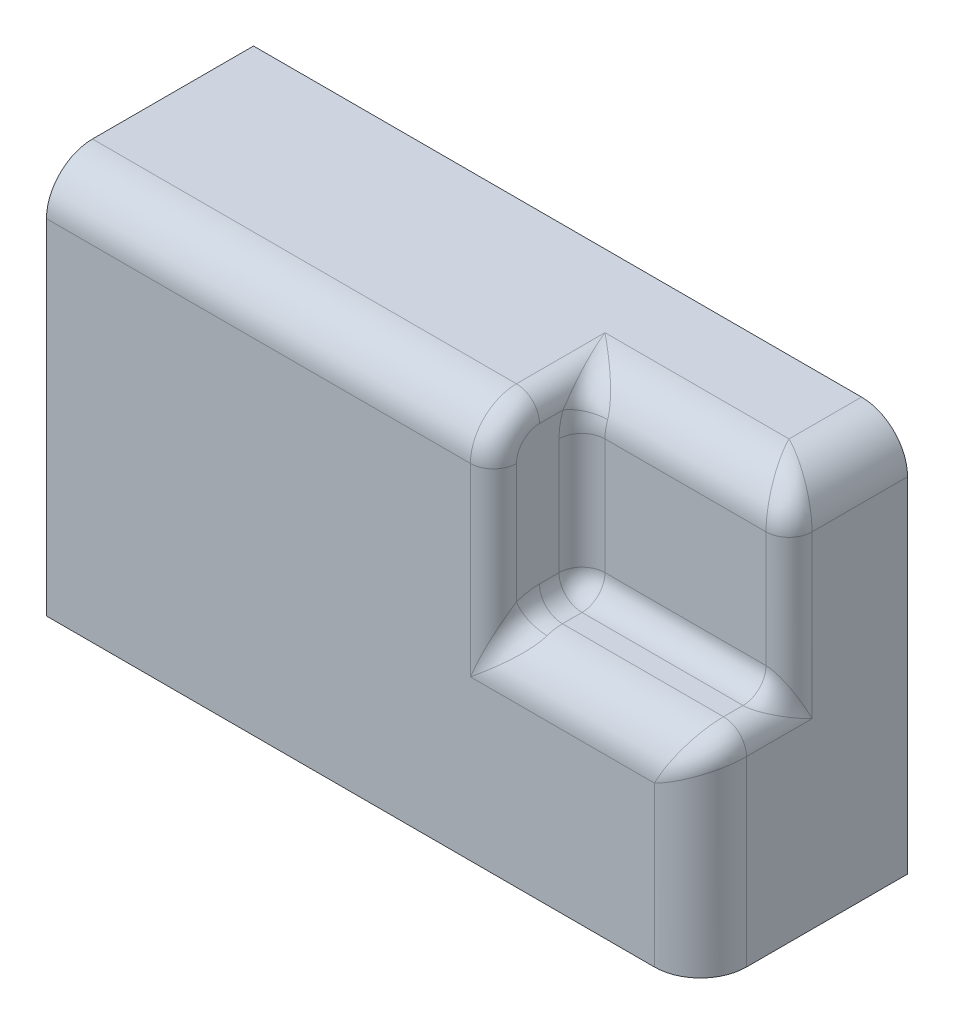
ISO-10303-21;
HEADER;
FILE_DESCRIPTION(('STEP AP214'),'2;1');
FILE_NAME('part.step','',(''),(''),'','','');
FILE_SCHEMA(('AUTOMOTIVE_DESIGN { 1 0 10303 214 1 1 1 1 }'));
ENDSEC;
DATA;
#1=APPLICATION_CONTEXT('core data for automotive mechanical design processes');
#2=APPLICATION_PROTOCOL_DEFINITION('international standard','automotive_design',2000,#1);
#3=PRODUCT_CONTEXT('',#1,'mechanical');
#4=PRODUCT('Part','Part','',(#3));
#5=PRODUCT_RELATED_PRODUCT_CATEGORY('part','',(#4));
#6=PRODUCT_DEFINITION_FORMATION('','',#4);
#7=PRODUCT_DEFINITION_CONTEXT('part definition',#1,'design');
#8=PRODUCT_DEFINITION('design','',#6,#7);
#9=PRODUCT_DEFINITION_SHAPE('','',#8);
#10=(LENGTH_UNIT() NAMED_UNIT(*) SI_UNIT(.MILLI.,.METRE.));
#11=(NAMED_UNIT(*) PLANE_ANGLE_UNIT() SI_UNIT($,.RADIAN.));
#12=(NAMED_UNIT(*) SI_UNIT($,.STERADIAN.) SOLID_ANGLE_UNIT());
#13=UNCERTAINTY_MEASURE_WITH_UNIT(LENGTH_MEASURE(1.E-05),#10,'distance_accuracy_value','');
#14=(GEOMETRIC_REPRESENTATION_CONTEXT(3) GLOBAL_UNCERTAINTY_ASSIGNED_CONTEXT((#13)) GLOBAL_UNIT_ASSIGNED_CONTEXT((#10,
#11,#12)) REPRESENTATION_CONTEXT('',''));
#15=CARTESIAN_POINT('',(0.,0.,0.));
#16=DIRECTION('',(0.,0.,1.));
#17=DIRECTION('',(1.,0.,0.));
#18=AXIS2_PLACEMENT_3D('',#15,#16,#17);
#19=CARTESIAN_POINT('',(0.,0.,22.86));
#20=DIRECTION('',(1.,0.,0.));
#21=DIRECTION('',(0.,0.,-1.));
#22=AXIS2_PLACEMENT_3D('',#19,#20,#21);
#23=PLANE('',#22);
#24=DIRECTION('',(0.,-1.,0.));
#25=VECTOR('',#24,1.);
#26=CARTESIAN_POINT('',(0.,0.,22.86));
#27=LINE('',#26,#25);
#28=CARTESIAN_POINT('',(0.,37.9903253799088,22.86));
#29=VERTEX_POINT('',#28);
#30=CARTESIAN_POINT('',(0.,0.,22.86));
#31=VERTEX_POINT('',#30);
#32=EDGE_CURVE('E165',#29,#31,#27,.T.);
#33=ORIENTED_EDGE('',*,*,#32,.F.);
#34=CARTESIAN_POINT('',(0.,37.9903253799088,17.78));
#35=DIRECTION('',(1.,0.,0.));
#36=DIRECTION('',(0.,0.,-1.));
#37=AXIS2_PLACEMENT_3D('',#34,#35,#36);
#38=CIRCLE('',#37,5.08);
#39=CARTESIAN_POINT('',(0.,43.0703253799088,17.78));
#40=VERTEX_POINT('',#39);
#41=EDGE_CURVE('E219',#29,#40,#38,.F.);
#42=ORIENTED_EDGE('',*,*,#41,.T.);
#43=DIRECTION('',(0.,0.,-1.));
#44=VECTOR('',#43,1.);
#45=CARTESIAN_POINT('',(0.,43.0703253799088,22.86));
#46=LINE('',#45,#44);
#47=CARTESIAN_POINT('',(0.,43.0703253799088,0.));
#48=VERTEX_POINT('',#47);
#49=EDGE_CURVE('E188',#40,#48,#46,.T.);
#50=ORIENTED_EDGE('',*,*,#49,.T.);
#51=DIRECTION('',(0.,-1.,0.));
#52=VECTOR('',#51,1.);
#53=CARTESIAN_POINT('',(0.,0.,0.));
#54=LINE('',#53,#52);
#55=CARTESIAN_POINT('',(0.,0.,0.));
#56=VERTEX_POINT('',#55);
#57=EDGE_CURVE('E191',#48,#56,#54,.T.);
#58=ORIENTED_EDGE('',*,*,#57,.T.);
#59=DIRECTION('',(0.,0.,-1.));
#60=VECTOR('',#59,1.);
#61=CARTESIAN_POINT('',(0.,0.,22.86));
#62=LINE('',#61,#60);
#63=EDGE_CURVE('E184',#31,#56,#62,.T.);
#64=ORIENTED_EDGE('',*,*,#63,.F.);
#65=EDGE_LOOP('',(#33,#42,#50,#58,#64));
#66=FACE_BOUND('',#65,.T.);
#67=ADVANCED_FACE('F34',(#66),#23,.F.);
#68=CARTESIAN_POINT('',(0.,0.,22.86));
#69=DIRECTION('',(0.,1.,0.));
#70=DIRECTION('',(0.,0.,1.));
#71=AXIS2_PLACEMENT_3D('',#68,#69,#70);
#72=PLANE('',#71);
#73=DIRECTION('',(0.,0.,-1.));
#74=VECTOR('',#73,1.);
#75=CARTESIAN_POINT('',(72.2061337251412,0.,22.86));
#76=LINE('',#75,#74);
#77=CARTESIAN_POINT('',(72.2061337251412,0.,17.78));
#78=VERTEX_POINT('',#77);
#79=CARTESIAN_POINT('',(72.2061337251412,0.,0.));
#80=VERTEX_POINT('',#79);
#81=EDGE_CURVE('E193',#78,#80,#76,.T.);
#82=ORIENTED_EDGE('',*,*,#81,.F.);
#83=CARTESIAN_POINT('',(67.1261337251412,0.,17.78));
#84=DIRECTION('',(0.,1.,0.));
#85=DIRECTION('',(0.,0.,1.));
#86=AXIS2_PLACEMENT_3D('',#83,#84,#85);
#87=CIRCLE('',#86,5.08);
#88=CARTESIAN_POINT('',(67.1261337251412,0.,22.86));
#89=VERTEX_POINT('',#88);
#90=EDGE_CURVE('E187',#78,#89,#87,.F.);
#91=ORIENTED_EDGE('',*,*,#90,.T.);
#92=DIRECTION('',(1.,0.,0.));
#93=VECTOR('',#92,1.);
#94=CARTESIAN_POINT('',(0.,0.,22.86));
#95=LINE('',#94,#93);
#96=EDGE_CURVE('E170',#31,#89,#95,.T.);
#97=ORIENTED_EDGE('',*,*,#96,.F.);
#98=ORIENTED_EDGE('',*,*,#63,.T.);
#99=DIRECTION('',(1.,0.,0.));
#100=VECTOR('',#99,1.);
#101=CARTESIAN_POINT('',(0.,0.,0.));
#102=LINE('',#101,#100);
#103=EDGE_CURVE('E538',#56,#80,#102,.T.);
#104=ORIENTED_EDGE('',*,*,#103,.T.);
#105=EDGE_LOOP('',(#82,#91,#97,#98,#104));
#106=FACE_BOUND('',#105,.T.);
#107=ADVANCED_FACE('F182',(#106),#72,.F.);
#108=CARTESIAN_POINT('',(72.2061337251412,0.,22.86));
#109=DIRECTION('',(-1.,0.,0.));
#110=DIRECTION('',(0.,0.,1.));
#111=AXIS2_PLACEMENT_3D('',#108,#109,#110);
#112=PLANE('',#111);
#113=DIRECTION('',(0.,1.,0.));
#114=VECTOR('',#113,1.);
#115=CARTESIAN_POINT('',(72.2061337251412,0.,10.5439445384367));
#116=LINE('',#115,#114);
#117=CARTESIAN_POINT('',(72.2061337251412,37.9903253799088,10.5439445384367));
#118=VERTEX_POINT('',#117);
#119=CARTESIAN_POINT('',(72.2061337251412,20.1242665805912,10.5439445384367));
#120=VERTEX_POINT('',#119);
#121=EDGE_CURVE('E249',#118,#120,#116,.F.);
#122=ORIENTED_EDGE('',*,*,#121,.T.);
#123=DIRECTION('',(0.,0.,-1.));
#124=VECTOR('',#123,1.);
#125=CARTESIAN_POINT('',(72.2061337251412,20.1242665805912,22.86));
#126=LINE('',#125,#124);
#127=CARTESIAN_POINT('',(72.2061337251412,20.1242665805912,17.78));
#128=VERTEX_POINT('',#127);
#129=EDGE_CURVE('E252',#120,#128,#126,.F.);
#130=ORIENTED_EDGE('',*,*,#129,.T.);
#131=DIRECTION('',(0.,1.,0.));
#132=VECTOR('',#131,1.);
#133=CARTESIAN_POINT('',(72.2061337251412,0.,17.78));
#134=LINE('',#133,#132);
#135=EDGE_CURVE('E208',#128,#78,#134,.F.);
#136=ORIENTED_EDGE('',*,*,#135,.T.);
#137=ORIENTED_EDGE('',*,*,#81,.T.);
#138=DIRECTION('',(0.,1.,0.));
#139=VECTOR('',#138,1.);
#140=CARTESIAN_POINT('',(72.2061337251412,0.,0.));
#141=LINE('',#140,#139);
#142=CARTESIAN_POINT('',(72.2061337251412,37.9903253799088,0.));
#143=VERTEX_POINT('',#142);
#144=EDGE_CURVE('E537',#80,#143,#141,.T.);
#145=ORIENTED_EDGE('',*,*,#144,.T.);
#146=DIRECTION('',(0.,0.,-1.));
#147=VECTOR('',#146,1.);
#148=CARTESIAN_POINT('',(72.2061337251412,37.9903253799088,22.86));
#149=LINE('',#148,#147);
#150=EDGE_CURVE('E210',#143,#118,#149,.F.);
#151=ORIENTED_EDGE('',*,*,#150,.T.);
#152=EDGE_LOOP('',(#122,#130,#136,#137,#145,#151));
#153=FACE_BOUND('',#152,.T.);
#154=ADVANCED_FACE('F485',(#153),#112,.F.);
#155=CARTESIAN_POINT('',(0.,43.0703253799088,22.86));
#156=DIRECTION('',(0.,-1.,0.));
#157=DIRECTION('',(0.,0.,-1.));
#158=AXIS2_PLACEMENT_3D('',#155,#156,#157);
#159=PLANE('',#158);
#160=DIRECTION('',(-1.,0.,0.));
#161=VECTOR('',#160,1.);
#162=CARTESIAN_POINT('',(0.,43.0703253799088,17.78));
#163=LINE('',#162,#161);
#164=CARTESIAN_POINT('',(46.8061337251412,43.0703253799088,17.78));
#165=VERTEX_POINT('',#164);
#166=EDGE_CURVE('E203',#40,#165,#163,.F.);
#167=ORIENTED_EDGE('',*,*,#166,.T.);
#168=DIRECTION('',(0.,0.,1.));
#169=VECTOR('',#168,1.);
#170=CARTESIAN_POINT('',(46.8061337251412,43.0703253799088,8.00394453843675));
#171=LINE('',#170,#169);
#172=CARTESIAN_POINT('',(46.8061337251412,43.0703253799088,8.00394453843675));
#173=VERTEX_POINT('',#172);
#174=EDGE_CURVE('E242',#165,#173,#171,.F.);
#175=ORIENTED_EDGE('',*,*,#174,.T.);
#176=DIRECTION('',(1.,0.,0.));
#177=VECTOR('',#176,1.);
#178=CARTESIAN_POINT('',(0.,43.0703253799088,8.00394453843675));
#179=LINE('',#178,#177);
#180=CARTESIAN_POINT('',(67.1261337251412,43.0703253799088,8.00394453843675));
#181=VERTEX_POINT('',#180);
#182=EDGE_CURVE('E192',#173,#181,#179,.T.);
#183=ORIENTED_EDGE('',*,*,#182,.T.);
#184=DIRECTION('',(0.,0.,-1.));
#185=VECTOR('',#184,1.);
#186=CARTESIAN_POINT('',(67.1261337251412,43.0703253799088,22.86));
#187=LINE('',#186,#185);
#188=CARTESIAN_POINT('',(67.1261337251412,43.0703253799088,0.));
#189=VERTEX_POINT('',#188);
#190=EDGE_CURVE('E196',#181,#189,#187,.T.);
#191=ORIENTED_EDGE('',*,*,#190,.T.);
#192=DIRECTION('',(-1.,0.,0.));
#193=VECTOR('',#192,1.);
#194=CARTESIAN_POINT('',(0.,43.0703253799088,0.));
#195=LINE('',#194,#193);
#196=EDGE_CURVE('E177',#189,#48,#195,.T.);
#197=ORIENTED_EDGE('',*,*,#196,.T.);
#198=ORIENTED_EDGE('',*,*,#49,.F.);
#199=EDGE_LOOP('',(#167,#175,#183,#191,#197,#198));
#200=FACE_BOUND('',#199,.T.);
#201=ADVANCED_FACE('F500',(#200),#159,.F.);
#202=CARTESIAN_POINT('',(0.,0.,22.86));
#203=DIRECTION('',(0.,0.,-1.));
#204=DIRECTION('',(-1.,0.,0.));
#205=AXIS2_PLACEMENT_3D('',#202,#203,#204);
#206=PLANE('',#205);
#207=DIRECTION('',(1.,0.,0.));
#208=VECTOR('',#207,1.);
#209=CARTESIAN_POINT('',(0.,17.5842665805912,22.86));
#210=LINE('',#209,#208);
#211=CARTESIAN_POINT('',(67.1261337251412,17.5842665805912,22.86));
#212=VERTEX_POINT('',#211);
#213=CARTESIAN_POINT('',(46.8061337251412,17.5842665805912,22.86));
#214=VERTEX_POINT('',#213);
#215=EDGE_CURVE('E213',#212,#214,#210,.F.);
#216=ORIENTED_EDGE('',*,*,#215,.T.);
#217=DIRECTION('',(0.,-1.,0.));
#218=VECTOR('',#217,1.);
#219=CARTESIAN_POINT('',(46.8061337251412,37.9903253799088,22.86));
#220=LINE('',#219,#218);
#221=CARTESIAN_POINT('',(46.8061337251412,37.9903253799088,22.86));
#222=VERTEX_POINT('',#221);
#223=EDGE_CURVE('E256',#214,#222,#220,.F.);
#224=ORIENTED_EDGE('',*,*,#223,.T.);
#225=DIRECTION('',(-1.,0.,0.));
#226=VECTOR('',#225,1.);
#227=CARTESIAN_POINT('',(0.,37.9903253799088,22.86));
#228=LINE('',#227,#226);
#229=EDGE_CURVE('E173',#222,#29,#228,.T.);
#230=ORIENTED_EDGE('',*,*,#229,.T.);
#231=ORIENTED_EDGE('',*,*,#32,.T.);
#232=ORIENTED_EDGE('',*,*,#96,.T.);
#233=DIRECTION('',(0.,1.,0.));
#234=VECTOR('',#233,1.);
#235=CARTESIAN_POINT('',(67.1261337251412,0.,22.86));
#236=LINE('',#235,#234);
#237=EDGE_CURVE('E215',#89,#212,#236,.T.);
#238=ORIENTED_EDGE('',*,*,#237,.T.);
#239=EDGE_LOOP('',(#216,#224,#230,#231,#232,#238));
#240=FACE_BOUND('',#239,.T.);
#241=ADVANCED_FACE('F168',(#240),#206,.F.);
#242=CARTESIAN_POINT('',(0.,0.,0.));
#243=DIRECTION('',(0.,0.,-1.));
#244=DIRECTION('',(-1.,0.,0.));
#245=AXIS2_PLACEMENT_3D('',#242,#243,#244);
#246=PLANE('',#245);
#247=ORIENTED_EDGE('',*,*,#196,.F.);
#248=CARTESIAN_POINT('',(67.1261337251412,37.9903253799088,0.));
#249=DIRECTION('',(0.,0.,-1.));
#250=DIRECTION('',(-1.,0.,0.));
#251=AXIS2_PLACEMENT_3D('',#248,#249,#250);
#252=CIRCLE('',#251,5.08);
#253=EDGE_CURVE('E206',#189,#143,#252,.T.);
#254=ORIENTED_EDGE('',*,*,#253,.T.);
#255=ORIENTED_EDGE('',*,*,#144,.F.);
#256=ORIENTED_EDGE('',*,*,#103,.F.);
#257=ORIENTED_EDGE('',*,*,#57,.F.);
#258=EDGE_LOOP('',(#247,#254,#255,#256,#257));
#259=FACE_BOUND('',#258,.T.);
#260=ADVANCED_FACE('F504',(#259),#246,.T.);
#261=CARTESIAN_POINT('',(49.3461337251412,43.0703253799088,13.0839445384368));
#262=DIRECTION('',(0.,0.,-1.));
#263=DIRECTION('',(0.,1.,0.));
#264=AXIS2_PLACEMENT_3D('',#261,#262,#263);
#265=PLANE('',#264);
#266=DIRECTION('',(0.,1.,0.));
#267=VECTOR('',#266,1.);
#268=CARTESIAN_POINT('',(51.8861337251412,43.0703253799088,13.0839445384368));
#269=LINE('',#268,#267);
#270=CARTESIAN_POINT('',(51.8861337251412,37.9903253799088,13.0839445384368));
#271=VERTEX_POINT('',#270);
#272=CARTESIAN_POINT('',(51.8861337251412,25.2042665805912,13.0839445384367));
#273=VERTEX_POINT('',#272);
#274=EDGE_CURVE('E61',#271,#273,#269,.F.);
#275=ORIENTED_EDGE('',*,*,#274,.T.);
#276=DIRECTION('',(1.,0.,0.));
#277=VECTOR('',#276,1.);
#278=CARTESIAN_POINT('',(69.6661337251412,25.2042665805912,13.0839445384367));
#279=LINE('',#278,#277);
#280=CARTESIAN_POINT('',(69.6661337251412,25.2042665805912,13.0839445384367));
#281=VERTEX_POINT('',#280);
#282=EDGE_CURVE('E447',#273,#281,#279,.T.);
#283=ORIENTED_EDGE('',*,*,#282,.T.);
#284=DIRECTION('',(0.,1.,0.));
#285=VECTOR('',#284,1.);
#286=CARTESIAN_POINT('',(69.6661337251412,43.0703253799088,13.0839445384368));
#287=LINE('',#286,#285);
#288=CARTESIAN_POINT('',(69.6661337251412,37.9903253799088,13.0839445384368));
#289=VERTEX_POINT('',#288);
#290=EDGE_CURVE('E254',#281,#289,#287,.T.);
#291=ORIENTED_EDGE('',*,*,#290,.T.);
#292=DIRECTION('',(1.,0.,0.));
#293=VECTOR('',#292,1.);
#294=CARTESIAN_POINT('',(49.3461337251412,37.9903253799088,13.0839445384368));
#295=LINE('',#294,#293);
#296=EDGE_CURVE('E221',#289,#271,#295,.F.);
#297=ORIENTED_EDGE('',*,*,#296,.T.);
#298=EDGE_LOOP('',(#275,#283,#291,#297));
#299=FACE_BOUND('',#298,.T.);
#300=ADVANCED_FACE('F472',(#299),#265,.F.);
#301=CARTESIAN_POINT('',(49.3461337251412,22.6642665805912,22.86));
#302=DIRECTION('',(0.,-1.,0.));
#303=DIRECTION('',(0.,0.,-1.));
#304=AXIS2_PLACEMENT_3D('',#301,#302,#303);
#305=PLANE('',#304);
#306=DIRECTION('',(0.,0.,-1.));
#307=VECTOR('',#306,1.);
#308=CARTESIAN_POINT('',(69.6661337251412,22.6642665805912,22.86));
#309=LINE('',#308,#307);
#310=CARTESIAN_POINT('',(69.6661337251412,22.6642665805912,17.78));
#311=VERTEX_POINT('',#310);
#312=CARTESIAN_POINT('',(69.6661337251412,22.6642665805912,15.6239445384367));
#313=VERTEX_POINT('',#312);
#314=EDGE_CURVE('E247',#311,#313,#309,.T.);
#315=ORIENTED_EDGE('',*,*,#314,.T.);
#316=DIRECTION('',(1.,0.,0.));
#317=VECTOR('',#316,1.);
#318=CARTESIAN_POINT('',(49.3461337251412,22.6642665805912,15.6239445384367));
#319=LINE('',#318,#317);
#320=CARTESIAN_POINT('',(51.8861337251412,22.6642665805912,15.6239445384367));
#321=VERTEX_POINT('',#320);
#322=EDGE_CURVE('E11',#313,#321,#319,.F.);
#323=ORIENTED_EDGE('',*,*,#322,.T.);
#324=DIRECTION('',(0.,0.,-1.));
#325=VECTOR('',#324,1.);
#326=CARTESIAN_POINT('',(51.8861337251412,22.6642665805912,22.86));
#327=LINE('',#326,#325);
#328=CARTESIAN_POINT('',(51.8861337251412,22.6642665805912,17.78));
#329=VERTEX_POINT('',#328);
#330=EDGE_CURVE('E47',#321,#329,#327,.F.);
#331=ORIENTED_EDGE('',*,*,#330,.T.);
#332=DIRECTION('',(1.,0.,0.));
#333=VECTOR('',#332,1.);
#334=CARTESIAN_POINT('',(49.3461337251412,22.6642665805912,17.78));
#335=LINE('',#334,#333);
#336=EDGE_CURVE('E223',#329,#311,#335,.T.);
#337=ORIENTED_EDGE('',*,*,#336,.T.);
#338=EDGE_LOOP('',(#315,#323,#331,#337));
#339=FACE_BOUND('',#338,.T.);
#340=ADVANCED_FACE('F449',(#339),#305,.F.);
#341=CARTESIAN_POINT('',(49.3461337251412,0.,0.));
#342=DIRECTION('',(1.,0.,0.));
#343=DIRECTION('',(0.,0.,-1.));
#344=AXIS2_PLACEMENT_3D('',#341,#342,#343);
#345=PLANE('',#344);
#346=DIRECTION('',(0.,-1.,0.));
#347=VECTOR('',#346,1.);
#348=CARTESIAN_POINT('',(49.3461337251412,17.5842665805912,20.32));
#349=LINE('',#348,#347);
#350=CARTESIAN_POINT('',(49.3461337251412,37.9903253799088,20.32));
#351=VERTEX_POINT('',#350);
#352=CARTESIAN_POINT('',(49.3461337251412,24.7684714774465,20.32));
#353=VERTEX_POINT('',#352);
#354=EDGE_CURVE('E235',#351,#353,#349,.T.);
#355=ORIENTED_EDGE('',*,*,#354,.T.);
#356=CARTESIAN_POINT('',(49.3461337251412,17.5842665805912,17.78));
#357=DIRECTION('',(1.,0.,0.));
#358=DIRECTION('',(0.,0.,-1.));
#359=AXIS2_PLACEMENT_3D('',#356,#357,#358);
#360=CIRCLE('',#359,7.62);
#361=CARTESIAN_POINT('',(49.3461337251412,25.2042665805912,17.78));
#362=VERTEX_POINT('',#361);
#363=EDGE_CURVE('E425',#353,#362,#360,.F.);
#364=ORIENTED_EDGE('',*,*,#363,.T.);
#365=DIRECTION('',(0.,0.,-1.));
#366=VECTOR('',#365,1.);
#367=CARTESIAN_POINT('',(49.3461337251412,25.2042665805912,0.));
#368=LINE('',#367,#366);
#369=CARTESIAN_POINT('',(49.3461337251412,25.2042665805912,15.6239445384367));
#370=VERTEX_POINT('',#369);
#371=EDGE_CURVE('E433',#362,#370,#368,.T.);
#372=ORIENTED_EDGE('',*,*,#371,.T.);
#373=DIRECTION('',(0.,1.,0.));
#374=VECTOR('',#373,1.);
#375=CARTESIAN_POINT('',(49.3461337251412,0.,15.6239445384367));
#376=LINE('',#375,#374);
#377=CARTESIAN_POINT('',(49.3461337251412,37.9903253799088,15.6239445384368));
#378=VERTEX_POINT('',#377);
#379=EDGE_CURVE('E323',#370,#378,#376,.T.);
#380=ORIENTED_EDGE('',*,*,#379,.T.);
#381=CARTESIAN_POINT('',(49.3461337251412,37.9903253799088,8.00394453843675));
#382=DIRECTION('',(1.,0.,0.));
#383=DIRECTION('',(0.,0.,-1.));
#384=AXIS2_PLACEMENT_3D('',#381,#382,#383);
#385=CIRCLE('',#384,7.62);
#386=CARTESIAN_POINT('',(49.3461337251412,40.5303253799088,15.1881494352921));
#387=VERTEX_POINT('',#386);
#388=EDGE_CURVE('E429',#378,#387,#385,.F.);
#389=ORIENTED_EDGE('',*,*,#388,.T.);
#390=DIRECTION('',(0.,0.,1.));
#391=VECTOR('',#390,1.);
#392=CARTESIAN_POINT('',(49.3461337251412,40.5303253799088,17.78));
#393=LINE('',#392,#391);
#394=CARTESIAN_POINT('',(49.3461337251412,40.5303253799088,17.78));
#395=VERTEX_POINT('',#394);
#396=EDGE_CURVE('E240',#387,#395,#393,.T.);
#397=ORIENTED_EDGE('',*,*,#396,.T.);
#398=CARTESIAN_POINT('',(49.3461337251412,37.9903253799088,17.78));
#399=DIRECTION('',(1.,0.,0.));
#400=DIRECTION('',(0.,0.,-1.));
#401=AXIS2_PLACEMENT_3D('',#398,#399,#400);
#402=CIRCLE('',#401,2.54);
#403=EDGE_CURVE('E238',#395,#351,#402,.T.);
#404=ORIENTED_EDGE('',*,*,#403,.T.);
#405=EDGE_LOOP('',(#355,#364,#372,#380,#389,#397,#404));
#406=FACE_BOUND('',#405,.T.);
#407=ADVANCED_FACE('F456',(#406),#345,.T.);
#408=CARTESIAN_POINT('',(0.,37.9903253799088,8.00394453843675));
#409=DIRECTION('',(1.,0.,0.));
#410=DIRECTION('',(0.,0.,-1.));
#411=AXIS2_PLACEMENT_3D('',#408,#409,#410);
#412=CYLINDRICAL_SURFACE('',#411,5.08);
#413=ORIENTED_EDGE('',*,*,#182,.F.);
#414=CARTESIAN_POINT('',(49.2451022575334,39.8210775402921,15.5409617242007));
#415=CARTESIAN_POINT('',(49.1405720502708,39.4616180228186,12.9209479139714));
#416=CARTESIAN_POINT('',(51.6840707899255,38.7379949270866,13.0286226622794));
#417=CARTESIAN_POINT('',(49.2622555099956,39.8800218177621,15.523444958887));
#418=CARTESIAN_POINT('',(49.1544916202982,39.4773982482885,12.9069549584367));
#419=CARTESIAN_POINT('',(51.7183772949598,38.8165872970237,13.016944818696));
#420=CARTESIAN_POINT('',(49.2771882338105,39.9393834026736,15.5029279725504));
#421=CARTESIAN_POINT('',(49.1692531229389,39.4925649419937,12.894134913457));
#422=CARTESIAN_POINT('',(51.7482427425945,38.8957360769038,13.0032668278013));
#423=CARTESIAN_POINT('',(49.3026490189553,40.0584172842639,15.4558711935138));
#424=CARTESIAN_POINT('',(49.2005710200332,39.5237491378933,12.8703719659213));
#425=CARTESIAN_POINT('',(51.799164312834,39.0544479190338,12.9718956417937));
#426=CARTESIAN_POINT('',(49.3131796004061,40.1180893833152,15.4293348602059));
#427=CARTESIAN_POINT('',(49.217088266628,39.5397294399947,12.8594526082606));
#428=CARTESIAN_POINT('',(51.8202254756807,39.1340107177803,12.9542047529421));
#429=CARTESIAN_POINT('',(49.3298369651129,40.2368961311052,15.3703919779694));
#430=CARTESIAN_POINT('',(49.2518208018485,39.574409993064,12.8391172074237));
#431=CARTESIAN_POINT('',(51.8535402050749,39.292419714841,12.9149094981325));
#432=CARTESIAN_POINT('',(49.3359923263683,40.2960317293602,15.3380252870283));
#433=CARTESIAN_POINT('',(49.2699787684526,39.5930426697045,12.8297095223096));
#434=CARTESIAN_POINT('',(51.8658509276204,39.3712671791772,12.8933317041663));
#435=CARTESIAN_POINT('',(49.3441413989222,40.4137181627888,15.2674313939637));
#436=CARTESIAN_POINT('',(49.3074448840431,39.6347464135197,12.8114300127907));
#437=CARTESIAN_POINT('',(51.8821490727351,39.5281824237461,12.8462691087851));
#438=CARTESIAN_POINT('',(49.3461342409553,40.4722688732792,15.2292029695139));
#439=CARTESIAN_POINT('',(49.3267079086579,39.6577500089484,12.8025742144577));
#440=CARTESIAN_POINT('',(51.8861347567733,39.6062500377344,12.820783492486));
#441=CARTESIAN_POINT('',(49.3461330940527,40.6013563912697,15.1379212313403));
#442=CARTESIAN_POINT('',(49.3697004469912,39.7150902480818,12.7823021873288));
#443=CARTESIAN_POINT('',(51.8861324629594,39.778366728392,12.7599290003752));
#444=CARTESIAN_POINT('',(49.3431485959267,40.6716476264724,15.083464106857));
#445=CARTESIAN_POINT('',(49.3934486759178,39.7507191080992,12.770770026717));
#446=CARTESIAN_POINT('',(51.8801634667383,39.8720883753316,12.7236242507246));
#447=CARTESIAN_POINT('',(49.3316336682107,40.8101251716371,14.966669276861));
#448=CARTESIAN_POINT('',(49.4390608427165,39.8312515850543,12.7448472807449));
#449=CARTESIAN_POINT('',(51.8571336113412,40.056725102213,12.6457610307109));
#450=CARTESIAN_POINT('',(49.3230997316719,40.8783101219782,14.9043266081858));
#451=CARTESIAN_POINT('',(49.4608935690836,39.8759619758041,12.730517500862));
#452=CARTESIAN_POINT('',(51.8400657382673,40.1476383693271,12.6041992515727));
#453=CARTESIAN_POINT('',(49.289838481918,41.0791600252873,14.7062391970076));
#454=CARTESIAN_POINT('',(49.51996474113,40.022917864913,12.6806568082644));
#455=CARTESIAN_POINT('',(51.7735432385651,40.4154382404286,12.4721409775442));
#456=CARTESIAN_POINT('',(49.2574540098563,41.2079365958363,14.5595659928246));
#457=CARTESIAN_POINT('',(49.5516310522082,40.1386405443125,12.6381621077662));
#458=CARTESIAN_POINT('',(51.7087742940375,40.5871403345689,12.3743588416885));
#459=CARTESIAN_POINT('',(49.1673673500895,41.4795415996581,14.2081070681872));
#460=CARTESIAN_POINT('',(49.5896953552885,40.4222669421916,12.5122637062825));
#461=CARTESIAN_POINT('',(51.5286009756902,40.9492803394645,12.1400528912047));
#462=CARTESIAN_POINT('',(49.1056410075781,41.6191442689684,13.9976487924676));
#463=CARTESIAN_POINT('',(49.5904371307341,40.5953776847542,12.4230539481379));
#464=CARTESIAN_POINT('',(51.4051482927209,41.1354172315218,11.9997473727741));
#465=CARTESIAN_POINT('',(48.964351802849,41.8777094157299,13.5517834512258));
#466=CARTESIAN_POINT('',(49.5435593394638,40.9495193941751,12.2008973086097));
#467=CARTESIAN_POINT('',(51.122569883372,41.4801707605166,11.7025038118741));
#468=CARTESIAN_POINT('',(48.8847663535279,41.9966454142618,13.3163449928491));
#469=CARTESIAN_POINT('',(49.4976282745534,41.130361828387,12.0694318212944));
#470=CARTESIAN_POINT('',(50.9633989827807,41.6387520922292,11.5455448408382));
#471=CARTESIAN_POINT('',(48.6793354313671,42.2565485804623,12.7327397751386));
#472=CARTESIAN_POINT('',(49.3385354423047,41.5439501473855,11.7145623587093));
#473=CARTESIAN_POINT('',(50.5525371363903,41.9852896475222,11.1564746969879));
#474=CARTESIAN_POINT('',(48.5475303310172,42.388121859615,12.3763150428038));
#475=CARTESIAN_POINT('',(49.2073937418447,41.775530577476,11.4736760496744));
#476=CARTESIAN_POINT('',(50.2889269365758,42.1607206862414,10.9188582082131));
#477=CARTESIAN_POINT('',(48.2683729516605,42.6150049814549,11.6420432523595));
#478=CARTESIAN_POINT('',(48.8883770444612,42.1848205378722,10.9460829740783));
#479=CARTESIAN_POINT('',(49.730612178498,42.4632315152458,10.4293436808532));
#480=CARTESIAN_POINT('',(48.1209891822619,42.7102395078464,11.2641535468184));
#481=CARTESIAN_POINT('',(48.7009542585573,42.3662138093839,10.6585079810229));
#482=CARTESIAN_POINT('',(49.4358446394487,42.5902108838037,10.1774172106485));
#483=CARTESIAN_POINT('',(47.8767917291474,42.835975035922,10.6471404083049));
#484=CARTESIAN_POINT('',(48.3711401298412,42.6083661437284,10.1735177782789));
#485=CARTESIAN_POINT('',(48.9474497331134,42.7578582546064,9.76607511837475));
#486=CARTESIAN_POINT('',(47.7828772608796,42.8772058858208,10.4118707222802));
#487=CARTESIAN_POINT('',(48.2406814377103,42.6887061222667,9.98590106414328));
#488=CARTESIAN_POINT('',(48.759620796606,42.8128327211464,9.60922866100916));
#489=CARTESIAN_POINT('',(47.5926164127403,42.9476272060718,9.93805496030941));
#490=CARTESIAN_POINT('',(47.9710758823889,42.8264061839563,9.60405475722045));
#491=CARTESIAN_POINT('',(48.3790991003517,42.9067278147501,9.29335148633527));
#492=CARTESIAN_POINT('',(47.4962692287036,42.9768136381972,9.69950781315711));
#493=CARTESIAN_POINT('',(47.8315232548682,42.884278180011,9.40918721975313));
#494=CARTESIAN_POINT('',(48.1864047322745,42.9456430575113,9.13432005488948));
#495=CARTESIAN_POINT('',(47.2053521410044,43.0466550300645,8.98183154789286));
#496=CARTESIAN_POINT('',(47.4070845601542,43.0219675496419,8.82181218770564));
#497=CARTESIAN_POINT('',(47.6045705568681,43.0387649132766,8.65586921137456));
#498=CARTESIAN_POINT('',(47.0083037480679,43.0698922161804,8.49915798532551));
#499=CARTESIAN_POINT('',(47.1094082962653,43.0694512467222,8.41664966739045));
#500=CARTESIAN_POINT('',(47.2104737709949,43.0697478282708,8.33408683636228));
#501=CARTESIAN_POINT('',(46.8098142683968,43.0703233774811,8.01295999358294));
#502=CARTESIAN_POINT('',(46.811654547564,43.0703214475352,8.0114574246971));
#503=CARTESIAN_POINT('',(46.8134948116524,43.0703227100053,8.00995484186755));
#504=CARTESIAN_POINT('',(46.8079739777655,43.0703253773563,8.00845222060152));
#505=CARTESIAN_POINT('',(46.8088941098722,43.0703254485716,8.0077009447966));
#506=CARTESIAN_POINT('',(46.8098142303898,43.0703253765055,8.00694965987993));
#507=CARTESIAN_POINT('',(46.8061337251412,43.0703253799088,8.00394453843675));
#508=CARTESIAN_POINT('',(46.8061337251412,43.0703253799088,8.00394453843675));
#509=CARTESIAN_POINT('',(46.8061337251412,43.0703253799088,8.00394453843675));
#510=(BOUNDED_SURFACE() B_SPLINE_SURFACE(3,2,((#414,#415,#416),(#417,#418,#419),(#420,#421,
#422),(#423,#424,#425),(#426,#427,#428),(#429,#430,#431),(#432,#433,#434),(#435,#436,#437),
(#438,#439,#440),(#441,#442,#443),(#444,#445,#446),(#447,#448,#449),(#450,#451,#452),(#453,#454,
#455),(#456,#457,#458),(#459,#460,#461),(#462,#463,#464),(#465,#466,#467),(#468,#469,#470),
(#471,#472,#473),(#474,#475,#476),(#477,#478,#479),(#480,#481,#482),(#483,#484,#485),(#486,#487,
#488),(#489,#490,#491),(#492,#493,#494),(#495,#496,#497),(#498,#499,#500),(#501,#502,#503),
(#504,#505,#506),(#507,#508,#509)),.UNSPECIFIED.,.F.,.F.,.F.) B_SPLINE_SURFACE_WITH_KNOTS((4,2,
2,2,2,2,2,2,2,2,2,2,2,2,2,4),(3,3),(0.,0.371932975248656,0.743652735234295,1.11292161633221,
1.48226760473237,1.93415526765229,2.38632877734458,3.2918267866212,4.3983170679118,
5.50621473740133,7.04455772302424,8.58607200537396,9.5215354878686,10.4573123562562,
12.3228542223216,12.3403127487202),(0.,1.),
.UNSPECIFIED.) GEOMETRIC_REPRESENTATION_ITEM() RATIONAL_B_SPLINE_SURFACE(((1.,0.692424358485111,
1.),(1.,0.692091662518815,1.),(1.,0.6921573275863,1.),(1.,0.693080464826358,1.),(1.,
0.693937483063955,1.),(1.,0.69642979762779,1.),(1.,0.698059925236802,1.),(1.,0.702051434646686,
1.),(1.,0.704412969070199,1.),(1.,0.710402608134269,1.),(1.,0.71419582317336,1.),(1.,
0.722615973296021,1.),(1.,0.727243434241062,1.),(1.,0.742124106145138,1.),(1.,0.753366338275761,
1.),(1.,0.779669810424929,1.),(1.,0.795024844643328,1.),(1.,0.825579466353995,1.),(1.,
0.840778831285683,1.),(1.,0.87546954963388,1.),(1.,0.89433408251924,1.),(1.,0.927875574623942,
1.),(1.,0.942543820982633,1.),(1.,0.96223345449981,1.),(1.,0.968780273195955,1.),(1.,
0.980046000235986,1.),(1.,0.984764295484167,1.),(1.,0.996094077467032,1.),(1.,0.999928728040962,
1.),(1.,0.999999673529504,1.),(1.,1.00000000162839,1.),(1.,1.,1.))) REPRESENTATION_ITEM('') SURFACE());
#511=CARTESIAN_POINT('',(51.6840707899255,38.7379949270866,13.0286226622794));
#512=CARTESIAN_POINT('',(51.7183772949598,38.8165872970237,13.016944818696));
#513=CARTESIAN_POINT('',(51.7482427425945,38.8957360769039,13.0032668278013));
#514=CARTESIAN_POINT('',(51.799164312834,39.0544479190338,12.9718956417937));
#515=CARTESIAN_POINT('',(51.8202254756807,39.1340107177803,12.9542047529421));
#516=CARTESIAN_POINT('',(51.8535402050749,39.292419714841,12.9149094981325));
#517=CARTESIAN_POINT('',(51.8658509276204,39.3712671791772,12.8933317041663));
#518=CARTESIAN_POINT('',(51.8821490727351,39.5281824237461,12.8462691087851));
#519=CARTESIAN_POINT('',(51.8861347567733,39.6062500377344,12.820783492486));
#520=CARTESIAN_POINT('',(51.8861324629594,39.7783667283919,12.7599290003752));
#521=CARTESIAN_POINT('',(51.8801634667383,39.8720883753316,12.7236242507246));
#522=CARTESIAN_POINT('',(51.8571336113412,40.056725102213,12.6457610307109));
#523=CARTESIAN_POINT('',(51.8400657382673,40.1476383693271,12.6041992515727));
#524=CARTESIAN_POINT('',(51.7735432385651,40.4154382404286,12.4721409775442));
#525=CARTESIAN_POINT('',(51.7087742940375,40.5871403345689,12.3743588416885));
#526=CARTESIAN_POINT('',(51.5286009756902,40.9492803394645,12.1400528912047));
#527=CARTESIAN_POINT('',(51.4051482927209,41.1354172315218,11.9997473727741));
#528=CARTESIAN_POINT('',(51.122569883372,41.4801707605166,11.7025038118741));
#529=CARTESIAN_POINT('',(50.9633989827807,41.6387520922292,11.5455448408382));
#530=CARTESIAN_POINT('',(50.5525371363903,41.9852896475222,11.1564746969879));
#531=CARTESIAN_POINT('',(50.2889269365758,42.1607206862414,10.9188582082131));
#532=CARTESIAN_POINT('',(49.730612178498,42.4632315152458,10.4293436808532));
#533=CARTESIAN_POINT('',(49.4358446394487,42.5902108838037,10.1774172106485));
#534=CARTESIAN_POINT('',(48.9474497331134,42.7578582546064,9.76607511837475));
#535=CARTESIAN_POINT('',(48.759620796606,42.8128327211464,9.60922866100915));
#536=CARTESIAN_POINT('',(48.3790991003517,42.9067278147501,9.29335148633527));
#537=CARTESIAN_POINT('',(48.1864047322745,42.9456430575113,9.13432005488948));
#538=CARTESIAN_POINT('',(47.6045705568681,43.0387649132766,8.65586921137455));
#539=CARTESIAN_POINT('',(47.2104737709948,43.0697478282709,8.33408683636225));
#540=CARTESIAN_POINT('',(46.8134948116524,43.0703227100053,8.00995484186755));
#541=CARTESIAN_POINT('',(46.8098142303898,43.0703253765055,8.00694965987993));
#542=CARTESIAN_POINT('',(46.8061337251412,43.0703253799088,8.00394453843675));
#543=B_SPLINE_CURVE_WITH_KNOTS('',3,(#511,#512,#513,#514,#515,#516,#517,#518,#519,#520,#521,
#522,#523,#524,#525,#526,#527,#528,#529,#530,#531,#532,#533,#534,#535,#536,#537,#538,#539,#540,
#541,#542),.UNSPECIFIED.,.F.,.F.,(4,2,2,2,2,2,2,2,2,2,2,2,2,2,2,4),(0.,0.371932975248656,
0.743652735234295,1.11292161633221,1.48226760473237,1.93415526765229,2.38632877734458,
3.2918267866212,4.3983170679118,5.50621473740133,7.04455772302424,8.58607200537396,
9.5215354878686,10.4573123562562,12.3228542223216,12.3403127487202),.UNSPECIFIED.);
#544=CARTESIAN_POINT('',(51.8861337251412,39.6836587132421,12.7934144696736));
#545=VERTEX_POINT('',#544);
#546=EDGE_CURVE('E431',#173,#545,#543,.F.);
#547=ORIENTED_EDGE('',*,*,#546,.T.);
#548=CARTESIAN_POINT('',(51.8861337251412,37.9903253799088,8.00394453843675));
#549=DIRECTION('',(1.,0.,0.));
#550=DIRECTION('',(0.,0.,-1.));
#551=AXIS2_PLACEMENT_3D('',#548,#549,#550);
#552=CIRCLE('',#551,5.08);
#553=EDGE_CURVE('E428',#545,#271,#552,.T.);
#554=ORIENTED_EDGE('',*,*,#553,.T.);
#555=ORIENTED_EDGE('',*,*,#296,.F.);
#556=CARTESIAN_POINT('',(67.1261337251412,37.9903253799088,8.00394453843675));
#557=DIRECTION('',(-0.894427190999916,0.,0.447213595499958));
#558=DIRECTION('',(-0.447213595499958,0.,-0.894427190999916));
#559=AXIS2_PLACEMENT_3D('',#556,#557,#558);
#560=ELLIPSE('',#559,5.67961266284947,5.08);
#561=EDGE_CURVE('E233',#289,#181,#560,.T.);
#562=ORIENTED_EDGE('',*,*,#561,.T.);
#563=EDGE_LOOP('',(#413,#547,#554,#555,#562));
#564=FACE_BOUND('',#563,.T.);
#565=ADVANCED_FACE('F347',(#564),#412,.T.);
#566=CARTESIAN_POINT('',(67.1261337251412,37.9903253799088,22.86));
#567=DIRECTION('',(0.,0.,-1.));
#568=DIRECTION('',(-1.,0.,0.));
#569=AXIS2_PLACEMENT_3D('',#566,#567,#568);
#570=CYLINDRICAL_SURFACE('',#569,5.08);
#571=ORIENTED_EDGE('',*,*,#190,.F.);
#572=CARTESIAN_POINT('',(67.1261337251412,37.9903253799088,8.00394453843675));
#573=DIRECTION('',(-0.447213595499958,0.,0.894427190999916));
#574=DIRECTION('',(-0.894427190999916,0.,-0.447213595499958));
#575=AXIS2_PLACEMENT_3D('',#572,#573,#574);
#576=ELLIPSE('',#575,5.67961266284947,5.08);
#577=EDGE_CURVE('E231',#181,#118,#576,.F.);
#578=ORIENTED_EDGE('',*,*,#577,.T.);
#579=ORIENTED_EDGE('',*,*,#150,.F.);
#580=ORIENTED_EDGE('',*,*,#253,.F.);
#581=EDGE_LOOP('',(#571,#578,#579,#580));
#582=FACE_BOUND('',#581,.T.);
#583=ADVANCED_FACE('F288',(#582),#570,.T.);
#584=CARTESIAN_POINT('',(49.3461337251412,17.5842665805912,17.78));
#585=DIRECTION('',(1.,0.,0.));
#586=DIRECTION('',(0.,0.,-1.));
#587=AXIS2_PLACEMENT_3D('',#584,#585,#586);
#588=CYLINDRICAL_SURFACE('',#587,5.08);
#589=CARTESIAN_POINT('',(51.8861337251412,17.5842665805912,17.78));
#590=DIRECTION('',(1.,0.,0.));
#591=DIRECTION('',(0.,0.,-1.));
#592=AXIS2_PLACEMENT_3D('',#589,#590,#591);
#593=CIRCLE('',#592,5.08);
#594=CARTESIAN_POINT('',(51.8861337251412,22.3737365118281,19.4733333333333));
#595=VERTEX_POINT('',#594);
#596=EDGE_CURVE('E411',#329,#595,#593,.T.);
#597=ORIENTED_EDGE('',*,*,#596,.T.);
#598=CARTESIAN_POINT('',(51.6840707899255,22.6089447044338,18.5276695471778));
#599=CARTESIAN_POINT('',(49.1405720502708,22.5012699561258,19.2512926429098));
#600=CARTESIAN_POINT('',(49.2451022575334,25.1212837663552,19.6107521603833));
#601=CARTESIAN_POINT('',(51.7183772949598,22.5972668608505,18.6062619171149));
#602=CARTESIAN_POINT('',(49.1544916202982,22.4872770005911,19.2670728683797));
#603=CARTESIAN_POINT('',(49.2622555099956,25.1037670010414,19.6696964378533));
#604=CARTESIAN_POINT('',(51.7482427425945,22.5835888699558,18.685410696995));
#605=CARTESIAN_POINT('',(49.1692531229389,22.4744569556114,19.2822395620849));
#606=CARTESIAN_POINT('',(49.2771882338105,25.0832500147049,19.7290580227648));
#607=CARTESIAN_POINT('',(51.799164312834,22.5522176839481,18.844122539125));
#608=CARTESIAN_POINT('',(49.2005710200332,22.4506940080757,19.3134237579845));
#609=CARTESIAN_POINT('',(49.3026490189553,25.0361932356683,19.8480919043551));
#610=CARTESIAN_POINT('',(51.8202254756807,22.5345267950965,18.9236853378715));
#611=CARTESIAN_POINT('',(49.217088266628,22.439774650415,19.3294040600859));
#612=CARTESIAN_POINT('',(49.3131796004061,25.0096569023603,19.9077640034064));
#613=CARTESIAN_POINT('',(51.8535402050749,22.4952315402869,19.0820943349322));
#614=CARTESIAN_POINT('',(49.2518208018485,22.4194392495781,19.3640846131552));
#615=CARTESIAN_POINT('',(49.3298369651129,24.9507140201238,20.0265707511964));
#616=CARTESIAN_POINT('',(51.8658509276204,22.4736537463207,19.1609417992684));
#617=CARTESIAN_POINT('',(49.2699787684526,22.410031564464,19.3827172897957));
#618=CARTESIAN_POINT('',(49.3359923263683,24.9183473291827,20.0857063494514));
#619=CARTESIAN_POINT('',(51.8821490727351,22.4265911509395,19.3178570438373));
#620=CARTESIAN_POINT('',(49.3074448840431,22.3917520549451,19.4244210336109));
#621=CARTESIAN_POINT('',(49.3441413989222,24.8477534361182,20.2033927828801));
#622=CARTESIAN_POINT('',(51.8861347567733,22.4011055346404,19.3959246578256));
#623=CARTESIAN_POINT('',(49.3267079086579,22.3828962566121,19.4474246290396));
#624=CARTESIAN_POINT('',(49.3461342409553,24.8095250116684,20.2619434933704));
#625=CARTESIAN_POINT('',(51.8861324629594,22.3402510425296,19.5680413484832));
#626=CARTESIAN_POINT('',(49.3697004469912,22.3626242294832,19.504764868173));
#627=CARTESIAN_POINT('',(49.3461330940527,24.7182432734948,20.3910310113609));
#628=CARTESIAN_POINT('',(51.8801634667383,22.303946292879,19.6617629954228));
#629=CARTESIAN_POINT('',(49.3934486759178,22.3510920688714,19.5403937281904));
#630=CARTESIAN_POINT('',(49.3431485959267,24.6637861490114,20.4613222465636));
#631=CARTESIAN_POINT('',(51.8571336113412,22.2260830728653,19.8463997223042));
#632=CARTESIAN_POINT('',(49.4390608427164,22.3251693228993,19.6209262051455));
#633=CARTESIAN_POINT('',(49.3316336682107,24.5469913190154,20.5997997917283));
#634=CARTESIAN_POINT('',(51.8400657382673,22.1845212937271,19.9373129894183));
#635=CARTESIAN_POINT('',(49.4608935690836,22.3108395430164,19.6656365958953));
#636=CARTESIAN_POINT('',(49.3230997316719,24.4846486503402,20.6679847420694));
#637=CARTESIAN_POINT('',(51.7735432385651,22.0524630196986,20.2051128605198));
#638=CARTESIAN_POINT('',(49.51996474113,22.2609788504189,19.8125924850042));
#639=CARTESIAN_POINT('',(49.289838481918,24.2865612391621,20.8688346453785));
#640=CARTESIAN_POINT('',(51.7087742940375,21.9546808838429,20.3768149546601));
#641=CARTESIAN_POINT('',(49.5516310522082,22.2184841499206,19.9283151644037));
#642=CARTESIAN_POINT('',(49.2574540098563,24.139888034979,20.9976112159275));
#643=CARTESIAN_POINT('',(51.5286009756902,21.7203749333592,20.7389549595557));
#644=CARTESIAN_POINT('',(49.5896953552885,22.0925857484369,20.2119415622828));
#645=CARTESIAN_POINT('',(49.1673673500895,23.7884291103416,21.2692162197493));
#646=CARTESIAN_POINT('',(51.4051482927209,21.5800694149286,20.925091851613));
#647=CARTESIAN_POINT('',(49.5904371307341,22.0033759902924,20.3850523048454));
#648=CARTESIAN_POINT('',(49.1056410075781,23.577970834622,21.4088188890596));
#649=CARTESIAN_POINT('',(51.122569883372,21.2828258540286,21.2698453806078));
#650=CARTESIAN_POINT('',(49.5435593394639,21.7812193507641,20.7391940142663));
#651=CARTESIAN_POINT('',(48.964351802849,23.1321054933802,21.6673840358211));
#652=CARTESIAN_POINT('',(50.9633989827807,21.1258668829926,21.4284267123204));
#653=CARTESIAN_POINT('',(49.4976282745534,21.6497538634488,20.9200364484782));
#654=CARTESIAN_POINT('',(48.8847663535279,22.8966670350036,21.786320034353));
#655=CARTESIAN_POINT('',(50.5525371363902,20.7367967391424,21.7749642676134));
#656=CARTESIAN_POINT('',(49.3385354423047,21.2948844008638,21.3336247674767));
#657=CARTESIAN_POINT('',(48.6793354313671,22.313061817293,22.0462232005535));
#658=CARTESIAN_POINT('',(50.2889269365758,20.4991802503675,21.9503953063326));
#659=CARTESIAN_POINT('',(49.2073937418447,21.0539980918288,21.5652051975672));
#660=CARTESIAN_POINT('',(48.5475303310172,21.9566370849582,22.1777964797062));
#661=CARTESIAN_POINT('',(49.730612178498,20.0096657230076,22.252906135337));
#662=CARTESIAN_POINT('',(48.8883770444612,20.5264050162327,21.9744951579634));
#663=CARTESIAN_POINT('',(48.2683729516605,21.2223652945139,22.4046796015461));
#664=CARTESIAN_POINT('',(49.4358446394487,19.7577392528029,22.3798855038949));
#665=CARTESIAN_POINT('',(48.7009542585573,20.2388300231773,22.1558884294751));
#666=CARTESIAN_POINT('',(48.1209891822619,20.8444755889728,22.4999141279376));
#667=CARTESIAN_POINT('',(48.9474497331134,19.3463971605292,22.5475328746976));
#668=CARTESIAN_POINT('',(48.3711401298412,19.7538398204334,22.3980407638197));
#669=CARTESIAN_POINT('',(47.8767917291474,20.2274624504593,22.6256496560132));
#670=CARTESIAN_POINT('',(48.759620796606,19.1895507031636,22.6025073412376));
#671=CARTESIAN_POINT('',(48.2406814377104,19.5662231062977,22.4783807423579));
#672=CARTESIAN_POINT('',(47.7828772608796,19.9921927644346,22.666880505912));
#673=CARTESIAN_POINT('',(48.3790991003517,18.8736735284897,22.6964024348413));
#674=CARTESIAN_POINT('',(47.9710758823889,19.1843767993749,22.6160808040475));
#675=CARTESIAN_POINT('',(47.5926164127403,19.5183770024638,22.737301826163));
#676=CARTESIAN_POINT('',(48.1864047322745,18.7146420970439,22.7353176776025));
#677=CARTESIAN_POINT('',(47.8315232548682,18.9895092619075,22.6739528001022));
#678=CARTESIAN_POINT('',(47.4962692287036,19.2798298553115,22.7664882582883));
#679=CARTESIAN_POINT('',(47.604570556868,18.236191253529,22.8284395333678));
#680=CARTESIAN_POINT('',(47.4070845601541,18.4021342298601,22.8116421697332));
#681=CARTESIAN_POINT('',(47.2053521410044,18.5621535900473,22.8363296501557));
#682=CARTESIAN_POINT('',(47.2104737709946,17.9144088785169,22.859422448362));
#683=CARTESIAN_POINT('',(47.1094082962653,17.9969717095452,22.8591258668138));
#684=CARTESIAN_POINT('',(47.0083037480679,18.0794800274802,22.8595668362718));
#685=CARTESIAN_POINT('',(46.8134948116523,17.590276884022,22.8599973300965));
#686=CARTESIAN_POINT('',(46.811654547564,17.5917794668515,22.8599960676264));
#687=CARTESIAN_POINT('',(46.8098142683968,17.5932820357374,22.8599979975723));
#688=CARTESIAN_POINT('',(46.8098142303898,17.5872717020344,22.8599999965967));
#689=CARTESIAN_POINT('',(46.8088941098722,17.588022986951,22.8600000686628));
#690=CARTESIAN_POINT('',(46.8079739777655,17.588774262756,22.8599999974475));
#691=CARTESIAN_POINT('',(46.8061337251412,17.5842665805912,22.86));
#692=CARTESIAN_POINT('',(46.8061337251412,17.5842665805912,22.86));
#693=CARTESIAN_POINT('',(46.8061337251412,17.5842665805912,22.86));
#694=(BOUNDED_SURFACE() B_SPLINE_SURFACE(3,2,((#598,#599,#600),(#601,#602,#603),(#604,#605,
#606),(#607,#608,#609),(#610,#611,#612),(#613,#614,#615),(#616,#617,#618),(#619,#620,#621),
(#622,#623,#624),(#625,#626,#627),(#628,#629,#630),(#631,#632,#633),(#634,#635,#636),(#637,#638,
#639),(#640,#641,#642),(#643,#644,#645),(#646,#647,#648),(#649,#650,#651),(#652,#653,#654),
(#655,#656,#657),(#658,#659,#660),(#661,#662,#663),(#664,#665,#666),(#667,#668,#669),(#670,#671,
#672),(#673,#674,#675),(#676,#677,#678),(#679,#680,#681),(#682,#683,#684),(#685,#686,#687),
(#688,#689,#690),(#691,#692,#693)),.UNSPECIFIED.,.F.,.F.,.F.) B_SPLINE_SURFACE_WITH_KNOTS((4,2,
2,2,2,2,2,2,2,2,2,2,2,2,2,4),(3,3),(0.,0.371932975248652,0.743652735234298,1.11292161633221,
1.48226760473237,1.93415526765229,2.38632877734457,3.2918267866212,4.39831706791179,
5.50621473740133,7.04455772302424,8.58607200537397,9.52153548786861,10.4573123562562,
12.3228542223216,12.3403127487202),(0.,1.),
.UNSPECIFIED.) GEOMETRIC_REPRESENTATION_ITEM() RATIONAL_B_SPLINE_SURFACE(((1.,0.692424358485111,
1.),(1.,0.692091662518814,1.),(1.,0.692157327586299,1.),(1.,0.693080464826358,1.),(1.,
0.693937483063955,1.),(1.,0.69642979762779,1.),(1.,0.698059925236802,1.),(1.,0.702051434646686,
1.),(1.,0.704412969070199,1.),(1.,0.710402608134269,1.),(1.,0.71419582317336,1.),(1.,
0.722615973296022,1.),(1.,0.727243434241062,1.),(1.,0.742124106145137,1.),(1.,0.753366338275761,
1.),(1.,0.779669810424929,1.),(1.,0.795024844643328,1.),(1.,0.825579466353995,1.),(1.,
0.840778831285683,1.),(1.,0.87546954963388,1.),(1.,0.89433408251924,1.),(1.,0.927875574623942,
1.),(1.,0.942543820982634,1.),(1.,0.962233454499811,1.),(1.,0.968780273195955,1.),(1.,
0.980046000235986,1.),(1.,0.984764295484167,1.),(1.,0.996094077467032,1.),(1.,0.999928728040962,
1.),(1.,0.999999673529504,1.),(1.,1.00000000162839,1.),(1.,1.,1.))) REPRESENTATION_ITEM('') SURFACE());
#695=CARTESIAN_POINT('',(51.6840707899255,22.6089447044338,18.5276695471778));
#696=CARTESIAN_POINT('',(51.7183772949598,22.5972668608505,18.6062619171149));
#697=CARTESIAN_POINT('',(51.7482427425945,22.5835888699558,18.685410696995));
#698=CARTESIAN_POINT('',(51.799164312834,22.5522176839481,18.844122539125));
#699=CARTESIAN_POINT('',(51.8202254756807,22.5345267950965,18.9236853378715));
#700=CARTESIAN_POINT('',(51.8535402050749,22.4952315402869,19.0820943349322));
#701=CARTESIAN_POINT('',(51.8658509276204,22.4736537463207,19.1609417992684));
#702=CARTESIAN_POINT('',(51.8821490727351,22.4265911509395,19.3178570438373));
#703=CARTESIAN_POINT('',(51.8861347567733,22.4011055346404,19.3959246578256));
#704=CARTESIAN_POINT('',(51.8861324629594,22.3402510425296,19.5680413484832));
#705=CARTESIAN_POINT('',(51.8801634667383,22.303946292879,19.6617629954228));
#706=CARTESIAN_POINT('',(51.8571336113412,22.2260830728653,19.8463997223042));
#707=CARTESIAN_POINT('',(51.8400657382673,22.1845212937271,19.9373129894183));
#708=CARTESIAN_POINT('',(51.7735432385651,22.0524630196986,20.2051128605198));
#709=CARTESIAN_POINT('',(51.7087742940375,21.9546808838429,20.3768149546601));
#710=CARTESIAN_POINT('',(51.5286009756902,21.7203749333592,20.7389549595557));
#711=CARTESIAN_POINT('',(51.4051482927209,21.5800694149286,20.925091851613));
#712=CARTESIAN_POINT('',(51.122569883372,21.2828258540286,21.2698453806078));
#713=CARTESIAN_POINT('',(50.9633989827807,21.1258668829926,21.4284267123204));
#714=CARTESIAN_POINT('',(50.5525371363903,20.7367967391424,21.7749642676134));
#715=CARTESIAN_POINT('',(50.2889269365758,20.4991802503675,21.9503953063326));
#716=CARTESIAN_POINT('',(49.730612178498,20.0096657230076,22.252906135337));
#717=CARTESIAN_POINT('',(49.4358446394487,19.7577392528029,22.3798855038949));
#718=CARTESIAN_POINT('',(48.9474497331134,19.3463971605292,22.5475328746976));
#719=CARTESIAN_POINT('',(48.759620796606,19.1895507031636,22.6025073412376));
#720=CARTESIAN_POINT('',(48.3790991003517,18.8736735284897,22.6964024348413));
#721=CARTESIAN_POINT('',(48.1864047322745,18.7146420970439,22.7353176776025));
#722=CARTESIAN_POINT('',(47.604570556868,18.236191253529,22.8284395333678));
#723=CARTESIAN_POINT('',(47.2104737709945,17.9144088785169,22.8594224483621));
#724=CARTESIAN_POINT('',(46.8134948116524,17.590276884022,22.8599973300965));
#725=CARTESIAN_POINT('',(46.8098142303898,17.5872717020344,22.8599999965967));
#726=CARTESIAN_POINT('',(46.8061337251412,17.5842665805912,22.86));
#727=B_SPLINE_CURVE_WITH_KNOTS('',3,(#695,#696,#697,#698,#699,#700,#701,#702,#703,#704,#705,
#706,#707,#708,#709,#710,#711,#712,#713,#714,#715,#716,#717,#718,#719,#720,#721,#722,#723,#724,
#725,#726),.UNSPECIFIED.,.F.,.F.,(4,2,2,2,2,2,2,2,2,2,2,2,2,2,2,4),(0.,0.371932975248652,
0.743652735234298,1.11292161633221,1.48226760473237,1.93415526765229,2.38632877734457,
3.2918267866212,4.39831706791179,5.50621473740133,7.04455772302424,8.58607200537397,
9.52153548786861,10.4573123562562,12.3228542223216,12.3403127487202),.UNSPECIFIED.);
#728=EDGE_CURVE('E324',#595,#214,#727,.T.);
#729=ORIENTED_EDGE('',*,*,#728,.T.);
#730=ORIENTED_EDGE('',*,*,#215,.F.);
#731=CARTESIAN_POINT('',(67.1261337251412,17.5842665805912,17.78));
#732=DIRECTION('',(0.894427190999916,-0.447213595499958,0.));
#733=DIRECTION('',(0.447213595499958,0.894427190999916,0.));
#734=AXIS2_PLACEMENT_3D('',#731,#732,#733);
#735=ELLIPSE('',#734,5.67961266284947,5.08);
#736=EDGE_CURVE('E228',#212,#311,#735,.F.);
#737=ORIENTED_EDGE('',*,*,#736,.T.);
#738=ORIENTED_EDGE('',*,*,#336,.F.);
#739=EDGE_LOOP('',(#597,#729,#730,#737,#738));
#740=FACE_BOUND('',#739,.T.);
#741=ADVANCED_FACE('F285',(#740),#588,.T.);
#742=CARTESIAN_POINT('',(67.1261337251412,0.,17.78));
#743=DIRECTION('',(0.,1.,0.));
#744=DIRECTION('',(0.,0.,1.));
#745=AXIS2_PLACEMENT_3D('',#742,#743,#744);
#746=CYLINDRICAL_SURFACE('',#745,5.08);
#747=ORIENTED_EDGE('',*,*,#135,.F.);
#748=CARTESIAN_POINT('',(67.1261337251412,17.5842665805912,17.78));
#749=DIRECTION('',(0.447213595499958,-0.894427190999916,0.));
#750=DIRECTION('',(0.894427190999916,0.447213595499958,0.));
#751=AXIS2_PLACEMENT_3D('',#748,#749,#750);
#752=ELLIPSE('',#751,5.67961266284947,5.08);
#753=EDGE_CURVE('E225',#128,#212,#752,.T.);
#754=ORIENTED_EDGE('',*,*,#753,.T.);
#755=ORIENTED_EDGE('',*,*,#237,.F.);
#756=ORIENTED_EDGE('',*,*,#90,.F.);
#757=EDGE_LOOP('',(#747,#754,#755,#756));
#758=FACE_BOUND('',#757,.T.);
#759=ADVANCED_FACE('F282',(#758),#746,.T.);
#760=CARTESIAN_POINT('',(0.,37.9903253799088,17.78));
#761=DIRECTION('',(-1.,0.,0.));
#762=DIRECTION('',(0.,0.,1.));
#763=AXIS2_PLACEMENT_3D('',#760,#761,#762);
#764=CYLINDRICAL_SURFACE('',#763,5.08);
#765=ORIENTED_EDGE('',*,*,#229,.F.);
#766=CARTESIAN_POINT('',(46.8061337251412,37.9903253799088,17.78));
#767=DIRECTION('',(1.,0.,0.));
#768=DIRECTION('',(0.,0.,-1.));
#769=AXIS2_PLACEMENT_3D('',#766,#767,#768);
#770=CIRCLE('',#769,5.08);
#771=EDGE_CURVE('E245',#222,#165,#770,.F.);
#772=ORIENTED_EDGE('',*,*,#771,.T.);
#773=ORIENTED_EDGE('',*,*,#166,.F.);
#774=ORIENTED_EDGE('',*,*,#41,.F.);
#775=EDGE_LOOP('',(#765,#772,#773,#774));
#776=FACE_BOUND('',#775,.T.);
#777=ADVANCED_FACE('F279',(#776),#764,.T.);
#778=CARTESIAN_POINT('',(67.1261337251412,43.0703253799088,8.00394453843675));
#779=CARTESIAN_POINT('',(67.1261337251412,43.0703253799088,8.00394453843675));
#780=CARTESIAN_POINT('',(67.1261337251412,43.0703253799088,8.00394453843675));
#781=CARTESIAN_POINT('',(67.2367881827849,43.0702363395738,8.22525345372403));
#782=CARTESIAN_POINT('',(67.2921467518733,43.0702677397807,8.1699575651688));
#783=CARTESIAN_POINT('',(67.3474426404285,43.0702363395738,8.11459899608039));
#784=CARTESIAN_POINT('',(67.3474708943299,43.0558563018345,8.44661887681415));
#785=CARTESIAN_POINT('',(67.458619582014,43.0630768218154,8.33643039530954));
#786=CARTESIAN_POINT('',(67.5688080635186,43.0558563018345,8.22528170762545));
#787=CARTESIAN_POINT('',(67.5669329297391,42.998120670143,8.88554294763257));
#788=CARTESIAN_POINT('',(67.7906334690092,43.0339677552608,8.66844428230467));
#789=CARTESIAN_POINT('',(68.007732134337,42.998120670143,8.44474374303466));
#790=CARTESIAN_POINT('',(67.6757204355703,42.9550124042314,9.10311795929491));
#791=CARTESIAN_POINT('',(67.9571161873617,43.0120091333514,8.83492700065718));
#792=CARTESIAN_POINT('',(68.2253071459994,42.9550124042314,8.55353124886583));
#793=CARTESIAN_POINT('',(67.8895394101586,42.8404139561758,9.53075590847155));
#794=CARTESIAN_POINT('',(68.2891969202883,42.9526610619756,9.16700773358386));
#795=CARTESIAN_POINT('',(68.652945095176,42.8404139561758,8.76735022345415));
#796=CARTESIAN_POINT('',(67.9946032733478,42.7694119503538,9.74088363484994));
#797=CARTESIAN_POINT('',(68.4557244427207,42.9151931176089,9.33353525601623));
#798=CARTESIAN_POINT('',(68.8630728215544,42.7694119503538,8.87241408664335));
#799=CARTESIAN_POINT('',(68.1991452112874,42.5999679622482,10.1499675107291));
#800=CARTESIAN_POINT('',(68.7880064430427,42.8232675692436,9.66581725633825));
#801=CARTESIAN_POINT('',(69.2721566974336,42.5999679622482,9.07695602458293));
#802=CARTESIAN_POINT('',(68.2986971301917,42.5022450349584,10.3490713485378));
#803=CARTESIAN_POINT('',(68.95465796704,42.7687039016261,9.83246878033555));
#804=CARTESIAN_POINT('',(69.4712605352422,42.5022450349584,9.17650794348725));
#805=CARTESIAN_POINT('',(68.4904689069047,42.2808050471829,10.7326149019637));
#806=CARTESIAN_POINT('',(69.2872457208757,42.639945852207,10.1650565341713));
#807=CARTESIAN_POINT('',(69.8548040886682,42.2808050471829,9.36827972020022));
#808=CARTESIAN_POINT('',(68.5828212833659,42.158014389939,10.9173196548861));
#809=CARTESIAN_POINT('',(69.4540179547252,42.5656403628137,10.3318287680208));
#810=CARTESIAN_POINT('',(70.0395088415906,42.158014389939,9.46063209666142));
#811=CARTESIAN_POINT('',(68.7585512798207,41.8883286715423,11.2687796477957));
#812=CARTESIAN_POINT('',(69.7865461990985,42.393222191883,10.664357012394));
#813=CARTESIAN_POINT('',(70.3909688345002,41.8883286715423,9.63636209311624));
#814=CARTESIAN_POINT('',(68.8421365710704,41.7425266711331,11.435950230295));
#815=CARTESIAN_POINT('',(69.9530317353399,42.2950412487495,10.8308425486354));
#816=CARTESIAN_POINT('',(70.5581394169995,41.7425266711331,9.71994738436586));
#817=CARTESIAN_POINT('',(68.9988230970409,41.4291495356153,11.7493232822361));
#818=CARTESIAN_POINT('',(70.2836821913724,42.0688177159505,11.1614930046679));
#819=CARTESIAN_POINT('',(70.8715124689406,41.4291495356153,9.87663391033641));
#820=CARTESIAN_POINT('',(69.0722192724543,41.2627666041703,11.8961156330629));
#821=CARTESIAN_POINT('',(70.448408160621,41.9408399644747,11.3262189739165));
#822=CARTESIAN_POINT('',(71.0183048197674,41.2627666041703,9.95003008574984));
#823=CARTESIAN_POINT('',(69.2071802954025,40.9109879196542,12.1660376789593));
#824=CARTESIAN_POINT('',(70.772137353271,41.6472216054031,11.6499481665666));
#825=CARTESIAN_POINT('',(71.2882268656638,40.9109879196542,10.084991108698));
#826=CARTESIAN_POINT('',(69.269128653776,40.7267829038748,12.2899343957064));
#827=CARTESIAN_POINT('',(70.9314620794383,41.4819329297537,11.8092728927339));
#828=CARTESIAN_POINT('',(71.4121235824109,40.7267829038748,10.1469394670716));
#829=CARTESIAN_POINT('',(69.3800433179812,40.3425442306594,12.5117637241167));
#830=CARTESIAN_POINT('',(71.2374584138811,41.1055264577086,12.1152692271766));
#831=CARTESIAN_POINT('',(71.6339529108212,40.3425442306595,10.2578541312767));
#832=CARTESIAN_POINT('',(69.4294621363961,40.1435689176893,12.6106013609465));
#833=CARTESIAN_POINT('',(71.3841576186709,40.8952772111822,12.2619684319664));
#834=CARTESIAN_POINT('',(71.732790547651,40.1435689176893,10.3072729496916));
#835=CARTESIAN_POINT('',(69.5144074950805,39.7333827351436,12.7804920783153));
#836=CARTESIAN_POINT('',(71.653424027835,40.4239264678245,12.5312348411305));
#837=CARTESIAN_POINT('',(71.9026812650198,39.7333827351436,10.392218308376));
#838=CARTESIAN_POINT('',(69.5504044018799,39.5229620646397,12.852485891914));
#839=CARTESIAN_POINT('',(71.7757372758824,40.1644834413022,12.6535480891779));
#840=CARTESIAN_POINT('',(71.9746750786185,39.5229620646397,10.4282152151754));
#841=CARTESIAN_POINT('',(69.6078900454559,39.0938310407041,12.967457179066));
#842=CARTESIAN_POINT('',(71.98124470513,39.5983109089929,12.8590555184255));
#843=CARTESIAN_POINT('',(72.0896463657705,39.0938310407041,10.4857008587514));
#844=CARTESIAN_POINT('',(69.6297819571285,38.8755593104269,13.0112410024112));
#845=CARTESIAN_POINT('',(72.0640371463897,39.2942212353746,12.9418479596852));
#846=CARTESIAN_POINT('',(72.1334301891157,38.8755593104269,10.507592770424));
#847=CARTESIAN_POINT('',(69.6587854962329,38.4348824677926,13.06924808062));
#848=CARTESIAN_POINT('',(72.1766346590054,38.6551639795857,13.0544454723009));
#849=CARTESIAN_POINT('',(72.1914372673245,38.4348824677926,10.5365963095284));
#850=CARTESIAN_POINT('',(69.6661337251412,38.2126039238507,13.0839445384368));
#851=CARTESIAN_POINT('',(72.2061337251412,38.3237147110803,13.0839445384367));
#852=CARTESIAN_POINT('',(72.2061337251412,38.2126039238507,10.5439445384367));
#853=CARTESIAN_POINT('',(69.6661337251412,37.7680468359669,13.0839445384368));
#854=CARTESIAN_POINT('',(72.2061337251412,37.6569360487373,13.0839445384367));
#855=CARTESIAN_POINT('',(72.2061337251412,37.7680468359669,10.5439445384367));
#856=CARTESIAN_POINT('',(69.6587854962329,37.545768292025,13.06924808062));
#857=CARTESIAN_POINT('',(72.1766346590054,37.3254867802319,13.0544454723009));
#858=CARTESIAN_POINT('',(72.1914372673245,37.545768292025,10.5365963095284));
#859=CARTESIAN_POINT('',(69.6297819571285,37.1050914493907,13.0112410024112));
#860=CARTESIAN_POINT('',(72.0640371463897,36.686429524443,12.9418479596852));
#861=CARTESIAN_POINT('',(72.1334301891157,37.1050914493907,10.507592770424));
#862=CARTESIAN_POINT('',(69.6078900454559,36.8868197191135,12.967457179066));
#863=CARTESIAN_POINT('',(71.98124470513,36.3823398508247,12.8590555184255));
#864=CARTESIAN_POINT('',(72.0896463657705,36.8868197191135,10.4857008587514));
#865=CARTESIAN_POINT('',(69.5504044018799,36.4576886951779,12.852485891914));
#866=CARTESIAN_POINT('',(71.7757372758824,35.8161673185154,12.6535480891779));
#867=CARTESIAN_POINT('',(71.9746750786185,36.4576886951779,10.4282152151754));
#868=CARTESIAN_POINT('',(69.5144074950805,36.2472680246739,12.7804920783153));
#869=CARTESIAN_POINT('',(71.653424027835,35.5567242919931,12.5312348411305));
#870=CARTESIAN_POINT('',(71.9026812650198,36.2472680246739,10.392218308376));
#871=CARTESIAN_POINT('',(69.4294621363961,35.8370818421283,12.6106013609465));
#872=CARTESIAN_POINT('',(71.3841576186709,35.0853735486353,12.2619684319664));
#873=CARTESIAN_POINT('',(71.732790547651,35.8370818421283,10.3072729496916));
#874=CARTESIAN_POINT('',(69.3800433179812,35.6381065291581,12.5117637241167));
#875=CARTESIAN_POINT('',(71.2374584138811,34.875124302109,12.1152692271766));
#876=CARTESIAN_POINT('',(71.6339529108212,35.6381065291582,10.2578541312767));
#877=CARTESIAN_POINT('',(69.2691286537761,35.2538678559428,12.2899343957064));
#878=CARTESIAN_POINT('',(70.9314620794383,34.4987178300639,11.8092728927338));
#879=CARTESIAN_POINT('',(71.4121235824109,35.2538678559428,10.1469394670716));
#880=CARTESIAN_POINT('',(69.2071802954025,35.0696628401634,12.1660376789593));
#881=CARTESIAN_POINT('',(70.772137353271,34.3334291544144,11.6499481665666));
#882=CARTESIAN_POINT('',(71.2882268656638,35.0696628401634,10.084991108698));
#883=CARTESIAN_POINT('',(69.0722192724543,34.7178841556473,11.8961156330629));
#884=CARTESIAN_POINT('',(70.448408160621,34.0398107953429,11.3262189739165));
#885=CARTESIAN_POINT('',(71.0183048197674,34.7178841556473,9.95003008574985));
#886=CARTESIAN_POINT('',(68.9988230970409,34.5515012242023,11.7493232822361));
#887=CARTESIAN_POINT('',(70.2836821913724,33.9118330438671,11.1614930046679));
#888=CARTESIAN_POINT('',(70.8715124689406,34.5515012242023,9.87663391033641));
#889=CARTESIAN_POINT('',(68.8421365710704,34.2381240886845,11.435950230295));
#890=CARTESIAN_POINT('',(69.9530317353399,33.6856095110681,10.8308425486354));
#891=CARTESIAN_POINT('',(70.5581394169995,34.2381240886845,9.71994738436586));
#892=CARTESIAN_POINT('',(68.7585512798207,34.0923220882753,11.2687796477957));
#893=CARTESIAN_POINT('',(69.7865461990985,33.5874285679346,10.664357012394));
#894=CARTESIAN_POINT('',(70.3909688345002,34.0923220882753,9.63636209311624));
#895=CARTESIAN_POINT('',(68.5828212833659,33.8226363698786,10.9173196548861));
#896=CARTESIAN_POINT('',(69.4540179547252,33.4150103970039,10.3318287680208));
#897=CARTESIAN_POINT('',(70.0395088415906,33.8226363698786,9.46063209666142));
#898=CARTESIAN_POINT('',(68.4904689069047,33.6998457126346,10.7326149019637));
#899=CARTESIAN_POINT('',(69.2872457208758,33.3407049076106,10.1650565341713));
#900=CARTESIAN_POINT('',(69.8548040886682,33.6998457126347,9.36827972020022));
#901=CARTESIAN_POINT('',(68.2986971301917,33.4784057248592,10.3490713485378));
#902=CARTESIAN_POINT('',(68.95465796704,33.2119468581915,9.83246878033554));
#903=CARTESIAN_POINT('',(69.4712605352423,33.4784057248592,9.17650794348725));
#904=CARTESIAN_POINT('',(68.1991452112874,33.3806827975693,10.1499675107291));
#905=CARTESIAN_POINT('',(68.7880064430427,33.157383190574,9.66581725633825));
#906=CARTESIAN_POINT('',(69.2721566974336,33.3806827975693,9.07695602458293));
#907=CARTESIAN_POINT('',(67.9946032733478,33.2112388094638,9.74088363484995));
#908=CARTESIAN_POINT('',(68.4557244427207,33.0654576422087,9.33353525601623));
#909=CARTESIAN_POINT('',(68.8630728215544,33.2112388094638,8.87241408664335));
#910=CARTESIAN_POINT('',(67.8895394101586,33.1402368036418,9.53075590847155));
#911=CARTESIAN_POINT('',(68.2891969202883,33.0279896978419,9.16700773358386));
#912=CARTESIAN_POINT('',(68.652945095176,33.1402368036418,8.76735022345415));
#913=CARTESIAN_POINT('',(67.6757204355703,33.0256383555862,9.10311795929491));
#914=CARTESIAN_POINT('',(67.9571161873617,32.9686416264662,8.83492700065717));
#915=CARTESIAN_POINT('',(68.2253071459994,33.0256383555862,8.55353124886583));
#916=CARTESIAN_POINT('',(67.5669329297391,32.9825300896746,8.88554294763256));
#917=CARTESIAN_POINT('',(67.7906334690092,32.9466830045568,8.66844428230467));
#918=CARTESIAN_POINT('',(68.007732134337,32.9825300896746,8.44474374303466));
#919=CARTESIAN_POINT('',(67.3474708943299,32.9247944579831,8.44661887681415));
#920=CARTESIAN_POINT('',(67.458619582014,32.9175739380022,8.33643039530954));
#921=CARTESIAN_POINT('',(67.5688080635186,32.9247944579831,8.22528170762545));
#922=CARTESIAN_POINT('',(67.2367881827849,32.9104144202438,8.22525345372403));
#923=CARTESIAN_POINT('',(67.2921467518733,32.9103830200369,8.1699575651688));
#924=CARTESIAN_POINT('',(67.3474426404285,32.9104144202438,8.11459899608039));
#925=CARTESIAN_POINT('',(67.1261337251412,32.9103253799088,8.00394453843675));
#926=CARTESIAN_POINT('',(67.1261337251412,32.9103253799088,8.00394453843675));
#927=CARTESIAN_POINT('',(67.1261337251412,32.9103253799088,8.00394453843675));
#928=(BOUNDED_SURFACE() B_SPLINE_SURFACE(3,2,((#778,#779,#780),(#781,#782,#783),(#784,#785,
#786),(#787,#788,#789),(#790,#791,#792),(#793,#794,#795),(#796,#797,#798),(#799,#800,#801),
(#802,#803,#804),(#805,#806,#807),(#808,#809,#810),(#811,#812,#813),(#814,#815,#816),(#817,#818,
#819),(#820,#821,#822),(#823,#824,#825),(#826,#827,#828),(#829,#830,#831),(#832,#833,#834),
(#835,#836,#837),(#838,#839,#840),(#841,#842,#843),(#844,#845,#846),(#847,#848,#849),(#850,#851,
#852),(#853,#854,#855),(#856,#857,#858),(#859,#860,#861),(#862,#863,#864),(#865,#866,#867),
(#868,#869,#870),(#871,#872,#873),(#874,#875,#876),(#877,#878,#879),(#880,#881,#882),(#883,#884,
#885),(#886,#887,#888),(#889,#890,#891),(#892,#893,#894),(#895,#896,#897),(#898,#899,#900),
(#901,#902,#903),(#904,#905,#906),(#907,#908,#909),(#910,#911,#912),(#913,#914,#915),(#916,#917,
#918),(#919,#920,#921),(#922,#923,#924),(#925,#926,#927)),.UNSPECIFIED.,.F.,.F.,
.F.) B_SPLINE_SURFACE_WITH_KNOTS((4,2,2,2,2,2,2,2,2,2,2,2,2,2,2,2,2,2,2,2,2,2,2,2,4),(3,3),(0.,
0.469366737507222,0.934743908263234,1.39231532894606,1.83861475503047,2.270708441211,
2.6863853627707,3.08435356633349,3.46443387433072,3.82772826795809,4.17671879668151,
4.5152303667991,4.84818811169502,5.18114585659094,5.51965742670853,5.86864795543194,
6.23194234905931,6.61202265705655,7.00999086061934,7.42566778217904,7.85776146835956,
8.30406089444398,8.7616323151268,9.22700948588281,9.69637622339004),(0.,1.),
.UNSPECIFIED.) GEOMETRIC_REPRESENTATION_ITEM() RATIONAL_B_SPLINE_SURFACE(((1.,1.,1.),(1.,
1.00000566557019,1.),(1.,0.998576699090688,1.),(1.,0.992910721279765,1.),(1.,0.988697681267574,
1.),(1.,0.97761712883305,1.),(1.,0.970795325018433,1.),(1.,0.954789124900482,1.),(1.,
0.945667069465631,1.),(1.,0.92548796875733,1.),(1.,0.914501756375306,1.),(1.,0.891169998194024,
1.),(1.,0.878891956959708,1.),(1.,0.853706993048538,1.),(1.,0.84084914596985,1.),(1.,
0.815387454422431,1.),(1.,0.802798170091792,1.),(1.,0.778880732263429,1.),(1.,0.767521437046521,
1.),(1.,0.747118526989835,1.),(1.,0.738001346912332,1.),(1.,0.723039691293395,1.),(1.,
0.717105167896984,1.),(1.,0.709170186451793,1.),(1.,0.707106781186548,1.),(1.,0.707106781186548,
1.),(1.,0.709170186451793,1.),(1.,0.717105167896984,1.),(1.,0.723039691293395,1.),(1.,
0.738001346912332,1.),(1.,0.747118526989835,1.),(1.,0.767521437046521,1.),(1.,0.778880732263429,
1.),(1.,0.802798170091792,1.),(1.,0.815387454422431,1.),(1.,0.84084914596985,1.),(1.,
0.853706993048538,1.),(1.,0.878891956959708,1.),(1.,0.891169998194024,1.),(1.,0.914501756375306,
1.),(1.,0.925487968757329,1.),(1.,0.94566706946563,1.),(1.,0.954789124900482,1.),(1.,
0.970795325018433,1.),(1.,0.97761712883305,1.),(1.,0.988697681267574,1.),(1.,0.992910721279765,
1.),(1.,0.998576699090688,1.),(1.,1.00000566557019,1.),(1.,1.,1.))) REPRESENTATION_ITEM('') SURFACE());
#929=ORIENTED_EDGE('',*,*,#577,.F.);
#930=ORIENTED_EDGE('',*,*,#561,.F.);
#931=CARTESIAN_POINT('',(69.6661337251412,37.9903253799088,10.5439445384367));
#932=DIRECTION('',(0.,-1.,0.));
#933=DIRECTION('',(0.,0.,-1.));
#934=AXIS2_PLACEMENT_3D('',#931,#932,#933);
#935=CIRCLE('',#934,2.54);
#936=EDGE_CURVE('E262',#118,#289,#935,.T.);
#937=ORIENTED_EDGE('',*,*,#936,.F.);
#938=EDGE_LOOP('',(#929,#930,#937));
#939=FACE_BOUND('',#938,.T.);
#940=ADVANCED_FACE('F394',(#939),#928,.T.);
#941=CARTESIAN_POINT('',(69.6661337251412,43.0703253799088,10.5439445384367));
#942=DIRECTION('',(0.,1.,0.));
#943=DIRECTION('',(0.,0.,1.));
#944=AXIS2_PLACEMENT_3D('',#941,#942,#943);
#945=CYLINDRICAL_SURFACE('',#944,2.54);
#946=ORIENTED_EDGE('',*,*,#290,.F.);
#947=CARTESIAN_POINT('',(69.6661337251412,20.1242665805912,10.5439445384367));
#948=DIRECTION('',(0.,-0.447213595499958,0.894427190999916));
#949=DIRECTION('',(0.,-0.894427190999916,-0.447213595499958));
#950=AXIS2_PLACEMENT_3D('',#947,#948,#949);
#951=ELLIPSE('',#950,5.67961266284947,2.54);
#952=EDGE_CURVE('E410',#281,#120,#951,.F.);
#953=ORIENTED_EDGE('',*,*,#952,.T.);
#954=ORIENTED_EDGE('',*,*,#121,.F.);
#955=ORIENTED_EDGE('',*,*,#936,.T.);
#956=EDGE_LOOP('',(#946,#953,#954,#955));
#957=FACE_BOUND('',#956,.T.);
#958=ADVANCED_FACE('F391',(#957),#945,.T.);
#959=CARTESIAN_POINT('',(69.6661337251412,20.1242665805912,22.86));
#960=DIRECTION('',(0.,0.,-1.));
#961=DIRECTION('',(-1.,0.,0.));
#962=AXIS2_PLACEMENT_3D('',#959,#960,#961);
#963=CYLINDRICAL_SURFACE('',#962,2.54);
#964=ORIENTED_EDGE('',*,*,#129,.F.);
#965=CARTESIAN_POINT('',(69.6661337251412,20.1242665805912,10.5439445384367));
#966=DIRECTION('',(0.,-0.894427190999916,0.447213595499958));
#967=DIRECTION('',(0.,-0.447213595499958,-0.894427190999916));
#968=AXIS2_PLACEMENT_3D('',#965,#966,#967);
#969=ELLIPSE('',#968,5.67961266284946,2.54);
#970=EDGE_CURVE('E258',#120,#313,#969,.T.);
#971=ORIENTED_EDGE('',*,*,#970,.T.);
#972=ORIENTED_EDGE('',*,*,#314,.F.);
#973=CARTESIAN_POINT('',(69.6661337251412,20.1242665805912,17.78));
#974=DIRECTION('',(0.,0.,1.));
#975=DIRECTION('',(1.,0.,0.));
#976=AXIS2_PLACEMENT_3D('',#973,#974,#975);
#977=CIRCLE('',#976,2.54);
#978=EDGE_CURVE('E259',#128,#311,#977,.T.);
#979=ORIENTED_EDGE('',*,*,#978,.F.);
#980=EDGE_LOOP('',(#964,#971,#972,#979));
#981=FACE_BOUND('',#980,.T.);
#982=ADVANCED_FACE('F277',(#981),#963,.T.);
#983=CARTESIAN_POINT('',(67.1261337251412,17.5842665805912,22.86));
#984=CARTESIAN_POINT('',(67.1261337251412,17.5842665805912,22.86));
#985=CARTESIAN_POINT('',(67.1261337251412,17.5842665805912,22.86));
#986=CARTESIAN_POINT('',(67.3474426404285,17.6949210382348,22.859910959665));
#987=CARTESIAN_POINT('',(67.2921467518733,17.7502796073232,22.8599423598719));
#988=CARTESIAN_POINT('',(67.2367881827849,17.8055754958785,22.859910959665));
#989=CARTESIAN_POINT('',(67.5688080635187,17.8056037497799,22.8455309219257));
#990=CARTESIAN_POINT('',(67.458619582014,17.916752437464,22.8527514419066));
#991=CARTESIAN_POINT('',(67.3474708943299,18.0269409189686,22.8455309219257));
#992=CARTESIAN_POINT('',(68.007732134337,18.0250657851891,22.7877952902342));
#993=CARTESIAN_POINT('',(67.7906334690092,18.2487663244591,22.823642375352));
#994=CARTESIAN_POINT('',(67.5669329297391,18.465864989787,22.7877952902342));
#995=CARTESIAN_POINT('',(68.2253071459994,18.1338532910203,22.7446870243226));
#996=CARTESIAN_POINT('',(67.9571161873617,18.4152490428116,22.8016837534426));
#997=CARTESIAN_POINT('',(67.6757204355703,18.6834400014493,22.7446870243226));
#998=CARTESIAN_POINT('',(68.652945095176,18.3476722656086,22.630088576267));
#999=CARTESIAN_POINT('',(68.2891969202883,18.7473297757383,22.7423356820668));
#1000=CARTESIAN_POINT('',(67.8895394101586,19.111077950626,22.630088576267));
#1001=CARTESIAN_POINT('',(68.8630728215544,18.4527361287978,22.559086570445));
#1002=CARTESIAN_POINT('',(68.4557244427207,18.9138572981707,22.7048677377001));
#1003=CARTESIAN_POINT('',(67.9946032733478,19.3212056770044,22.559086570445));
#1004=CARTESIAN_POINT('',(69.2721566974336,18.6572780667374,22.3896425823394));
#1005=CARTESIAN_POINT('',(68.7880064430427,19.2461392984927,22.6129421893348));
#1006=CARTESIAN_POINT('',(68.1991452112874,19.7302895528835,22.3896425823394));
#1007=CARTESIAN_POINT('',(69.4712605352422,18.7568299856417,22.2919196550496));
#1008=CARTESIAN_POINT('',(68.95465796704,19.41279082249,22.5583785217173));
#1009=CARTESIAN_POINT('',(68.2986971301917,19.9293933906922,22.2919196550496));
#1010=CARTESIAN_POINT('',(69.8548040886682,18.9486017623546,22.0704796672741));
#1011=CARTESIAN_POINT('',(69.2872457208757,19.7453785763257,22.4296204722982));
#1012=CARTESIAN_POINT('',(68.4904689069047,20.3129369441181,22.0704796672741));
#1013=CARTESIAN_POINT('',(70.0395088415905,19.0409541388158,21.9476890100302));
#1014=CARTESIAN_POINT('',(69.4540179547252,19.9121508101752,22.3553149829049));
#1015=CARTESIAN_POINT('',(68.5828212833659,20.4976416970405,21.9476890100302));
#1016=CARTESIAN_POINT('',(70.3909688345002,19.2166841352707,21.6780032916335));
#1017=CARTESIAN_POINT('',(69.7865461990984,20.2446790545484,22.1828968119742));
#1018=CARTESIAN_POINT('',(68.7585512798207,20.8491016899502,21.6780032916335));
#1019=CARTESIAN_POINT('',(70.5581394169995,19.3002694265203,21.5322012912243));
#1020=CARTESIAN_POINT('',(69.9530317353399,20.4111645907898,22.0847158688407));
#1021=CARTESIAN_POINT('',(68.8421365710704,21.0162722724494,21.5322012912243));
#1022=CARTESIAN_POINT('',(70.8715124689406,19.4569559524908,21.2188241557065));
#1023=CARTESIAN_POINT('',(70.2836821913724,20.7418150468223,21.8584923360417));
#1024=CARTESIAN_POINT('',(68.9988230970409,21.3296453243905,21.2188241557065));
#1025=CARTESIAN_POINT('',(71.0183048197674,19.5303521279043,21.0524412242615));
#1026=CARTESIAN_POINT('',(70.448408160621,20.9065410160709,21.7305145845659));
#1027=CARTESIAN_POINT('',(69.0722192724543,21.4764376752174,21.0524412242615));
#1028=CARTESIAN_POINT('',(71.2882268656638,19.6653131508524,20.7006625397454));
#1029=CARTESIAN_POINT('',(70.772137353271,21.230270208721,21.4368962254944));
#1030=CARTESIAN_POINT('',(69.2071802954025,21.7463597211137,20.7006625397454));
#1031=CARTESIAN_POINT('',(71.4121235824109,19.727261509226,20.516457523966));
#1032=CARTESIAN_POINT('',(70.9314620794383,21.3895949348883,21.2716075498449));
#1033=CARTESIAN_POINT('',(69.269128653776,21.8702564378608,20.516457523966));
#1034=CARTESIAN_POINT('',(71.6339529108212,19.8381761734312,20.1322188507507));
#1035=CARTESIAN_POINT('',(71.2374584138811,21.695591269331,20.8952010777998));
#1036=CARTESIAN_POINT('',(69.3800433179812,22.0920857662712,20.1322188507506));
#1037=CARTESIAN_POINT('',(71.732790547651,19.8875949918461,19.9332435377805));
#1038=CARTESIAN_POINT('',(71.3841576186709,21.8422904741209,20.6849518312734));
#1039=CARTESIAN_POINT('',(69.4294621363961,22.190923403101,19.9332435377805));
#1040=CARTESIAN_POINT('',(71.9026812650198,19.9725403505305,19.5230573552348));
#1041=CARTESIAN_POINT('',(71.653424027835,22.1115568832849,20.2136010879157));
#1042=CARTESIAN_POINT('',(69.5144074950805,22.3608141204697,19.5230573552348));
#1043=CARTESIAN_POINT('',(71.9746750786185,20.0085372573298,19.3126366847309));
#1044=CARTESIAN_POINT('',(71.7757372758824,22.2338701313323,19.9541580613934));
#1045=CARTESIAN_POINT('',(69.5504044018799,22.4328079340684,19.3126366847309));
#1046=CARTESIAN_POINT('',(72.0896463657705,20.0660229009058,18.8835056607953));
#1047=CARTESIAN_POINT('',(71.98124470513,22.4393775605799,19.3879855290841));
#1048=CARTESIAN_POINT('',(69.6078900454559,22.5477792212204,18.8835056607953));
#1049=CARTESIAN_POINT('',(72.1334301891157,20.0879148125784,18.6652339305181));
#1050=CARTESIAN_POINT('',(72.0640371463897,22.5221700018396,19.0838958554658));
#1051=CARTESIAN_POINT('',(69.6297819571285,22.5915630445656,18.6652339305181));
#1052=CARTESIAN_POINT('',(72.1914372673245,20.1169183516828,18.2245570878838));
#1053=CARTESIAN_POINT('',(72.1766346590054,22.6347675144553,18.4448385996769));
#1054=CARTESIAN_POINT('',(69.6587854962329,22.6495701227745,18.2245570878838));
#1055=CARTESIAN_POINT('',(72.2061337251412,20.1242665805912,18.0022785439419));
#1056=CARTESIAN_POINT('',(72.2061337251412,22.6642665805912,18.1133893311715));
#1057=CARTESIAN_POINT('',(69.6661337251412,22.6642665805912,18.0022785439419));
#1058=CARTESIAN_POINT('',(72.2061337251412,20.1242665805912,17.5577214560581));
#1059=CARTESIAN_POINT('',(72.2061337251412,22.6642665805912,17.4466106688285));
#1060=CARTESIAN_POINT('',(69.6661337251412,22.6642665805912,17.5577214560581));
#1061=CARTESIAN_POINT('',(72.1914372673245,20.1169183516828,17.3354429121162));
#1062=CARTESIAN_POINT('',(72.1766346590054,22.6347675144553,17.1151614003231));
#1063=CARTESIAN_POINT('',(69.6587854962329,22.6495701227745,17.3354429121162));
#1064=CARTESIAN_POINT('',(72.1334301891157,20.0879148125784,16.8947660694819));
#1065=CARTESIAN_POINT('',(72.0640371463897,22.5221700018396,16.4761041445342));
#1066=CARTESIAN_POINT('',(69.6297819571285,22.5915630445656,16.8947660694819));
#1067=CARTESIAN_POINT('',(72.0896463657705,20.0660229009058,16.6764943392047));
#1068=CARTESIAN_POINT('',(71.98124470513,22.4393775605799,16.1720144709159));
#1069=CARTESIAN_POINT('',(69.6078900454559,22.5477792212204,16.6764943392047));
#1070=CARTESIAN_POINT('',(71.9746750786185,20.0085372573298,16.2473633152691));
#1071=CARTESIAN_POINT('',(71.7757372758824,22.2338701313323,15.6058419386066));
#1072=CARTESIAN_POINT('',(69.5504044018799,22.4328079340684,16.2473633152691));
#1073=CARTESIAN_POINT('',(71.9026812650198,19.9725403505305,16.0369426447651));
#1074=CARTESIAN_POINT('',(71.653424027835,22.1115568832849,15.3463989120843));
#1075=CARTESIAN_POINT('',(69.5144074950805,22.3608141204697,16.0369426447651));
#1076=CARTESIAN_POINT('',(71.732790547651,19.8875949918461,15.6267564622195));
#1077=CARTESIAN_POINT('',(71.3841576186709,21.8422904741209,14.8750481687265));
#1078=CARTESIAN_POINT('',(69.4294621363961,22.190923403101,15.6267564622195));
#1079=CARTESIAN_POINT('',(71.6339529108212,19.8381761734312,15.4277811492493));
#1080=CARTESIAN_POINT('',(71.2374584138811,21.695591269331,14.6647989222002));
#1081=CARTESIAN_POINT('',(69.3800433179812,22.0920857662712,15.4277811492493));
#1082=CARTESIAN_POINT('',(71.4121235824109,19.727261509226,15.043542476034));
#1083=CARTESIAN_POINT('',(70.9314620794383,21.3895949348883,14.2883924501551));
#1084=CARTESIAN_POINT('',(69.269128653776,21.8702564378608,15.043542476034));
#1085=CARTESIAN_POINT('',(71.2882268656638,19.6653131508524,14.8593374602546));
#1086=CARTESIAN_POINT('',(70.772137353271,21.230270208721,14.1231037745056));
#1087=CARTESIAN_POINT('',(69.2071802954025,21.7463597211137,14.8593374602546));
#1088=CARTESIAN_POINT('',(71.0183048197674,19.5303521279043,14.5075587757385));
#1089=CARTESIAN_POINT('',(70.448408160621,20.9065410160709,13.8294854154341));
#1090=CARTESIAN_POINT('',(69.0722192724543,21.4764376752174,14.5075587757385));
#1091=CARTESIAN_POINT('',(70.8715124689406,19.4569559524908,14.3411758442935));
#1092=CARTESIAN_POINT('',(70.2836821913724,20.7418150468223,13.7015076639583));
#1093=CARTESIAN_POINT('',(68.9988230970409,21.3296453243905,14.3411758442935));
#1094=CARTESIAN_POINT('',(70.5581394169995,19.3002694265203,14.0277987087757));
#1095=CARTESIAN_POINT('',(69.9530317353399,20.4111645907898,13.4752841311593));
#1096=CARTESIAN_POINT('',(68.8421365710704,21.0162722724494,14.0277987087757));
#1097=CARTESIAN_POINT('',(70.3909688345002,19.2166841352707,13.8819967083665));
#1098=CARTESIAN_POINT('',(69.7865461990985,20.2446790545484,13.3771031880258));
#1099=CARTESIAN_POINT('',(68.7585512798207,20.8491016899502,13.8819967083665));
#1100=CARTESIAN_POINT('',(70.0395088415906,19.0409541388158,13.6123109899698));
#1101=CARTESIAN_POINT('',(69.4540179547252,19.9121508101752,13.2046850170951));
#1102=CARTESIAN_POINT('',(68.5828212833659,20.4976416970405,13.6123109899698));
#1103=CARTESIAN_POINT('',(69.8548040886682,18.9486017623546,13.4895203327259));
#1104=CARTESIAN_POINT('',(69.2872457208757,19.7453785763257,13.1303795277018));
#1105=CARTESIAN_POINT('',(68.4904689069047,20.3129369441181,13.4895203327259));
#1106=CARTESIAN_POINT('',(69.4712605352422,18.7568299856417,13.2680803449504));
#1107=CARTESIAN_POINT('',(68.95465796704,19.41279082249,13.0016214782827));
#1108=CARTESIAN_POINT('',(68.2986971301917,19.9293933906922,13.2680803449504));
#1109=CARTESIAN_POINT('',(69.2721566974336,18.6572780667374,13.1703574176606));
#1110=CARTESIAN_POINT('',(68.7880064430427,19.2461392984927,12.9470578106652));
#1111=CARTESIAN_POINT('',(68.1991452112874,19.7302895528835,13.1703574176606));
#1112=CARTESIAN_POINT('',(68.8630728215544,18.4527361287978,13.000913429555));
#1113=CARTESIAN_POINT('',(68.4557244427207,18.9138572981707,12.8551322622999));
#1114=CARTESIAN_POINT('',(67.9946032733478,19.3212056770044,13.000913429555));
#1115=CARTESIAN_POINT('',(68.652945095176,18.3476722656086,12.929911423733));
#1116=CARTESIAN_POINT('',(68.2891969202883,18.7473297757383,12.8176643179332));
#1117=CARTESIAN_POINT('',(67.8895394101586,19.111077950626,12.929911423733));
#1118=CARTESIAN_POINT('',(68.2253071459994,18.1338532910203,12.8153129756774));
#1119=CARTESIAN_POINT('',(67.9571161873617,18.4152490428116,12.7583162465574));
#1120=CARTESIAN_POINT('',(67.6757204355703,18.6834400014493,12.8153129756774));
#1121=CARTESIAN_POINT('',(68.007732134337,18.0250657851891,12.7722047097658));
#1122=CARTESIAN_POINT('',(67.7906334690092,18.2487663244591,12.736357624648));
#1123=CARTESIAN_POINT('',(67.5669329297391,18.465864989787,12.7722047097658));
#1124=CARTESIAN_POINT('',(67.5688080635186,17.8056037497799,12.7144690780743));
#1125=CARTESIAN_POINT('',(67.458619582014,17.916752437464,12.7072485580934));
#1126=CARTESIAN_POINT('',(67.3474708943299,18.0269409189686,12.7144690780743));
#1127=CARTESIAN_POINT('',(67.3474426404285,17.6949210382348,12.700089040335));
#1128=CARTESIAN_POINT('',(67.2921467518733,17.7502796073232,12.7000576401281));
#1129=CARTESIAN_POINT('',(67.2367881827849,17.8055754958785,12.700089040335));
#1130=CARTESIAN_POINT('',(67.1261337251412,17.5842665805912,12.7));
#1131=CARTESIAN_POINT('',(67.1261337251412,17.5842665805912,12.7));
#1132=CARTESIAN_POINT('',(67.1261337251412,17.5842665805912,12.7));
#1133=(BOUNDED_SURFACE() B_SPLINE_SURFACE(3,2,((#983,#984,#985),(#986,#987,#988),(#989,#990,
#991),(#992,#993,#994),(#995,#996,#997),(#998,#999,#1000),(#1001,#1002,#1003),(#1004,#1005,
#1006),(#1007,#1008,#1009),(#1010,#1011,#1012),(#1013,#1014,#1015),(#1016,#1017,#1018),(#1019,
#1020,#1021),(#1022,#1023,#1024),(#1025,#1026,#1027),(#1028,#1029,#1030),(#1031,#1032,#1033),
(#1034,#1035,#1036),(#1037,#1038,#1039),(#1040,#1041,#1042),(#1043,#1044,#1045),(#1046,#1047,
#1048),(#1049,#1050,#1051),(#1052,#1053,#1054),(#1055,#1056,#1057),(#1058,#1059,#1060),(#1061,
#1062,#1063),(#1064,#1065,#1066),(#1067,#1068,#1069),(#1070,#1071,#1072),(#1073,#1074,#1075),
(#1076,#1077,#1078),(#1079,#1080,#1081),(#1082,#1083,#1084),(#1085,#1086,#1087),(#1088,#1089,
#1090),(#1091,#1092,#1093),(#1094,#1095,#1096),(#1097,#1098,#1099),(#1100,#1101,#1102),(#1103,
#1104,#1105),(#1106,#1107,#1108),(#1109,#1110,#1111),(#1112,#1113,#1114),(#1115,#1116,#1117),
(#1118,#1119,#1120),(#1121,#1122,#1123),(#1124,#1125,#1126),(#1127,#1128,#1129),(#1130,#1131,
#1132)),.UNSPECIFIED.,.F.,.F.,.F.) B_SPLINE_SURFACE_WITH_KNOTS((4,2,2,2,2,2,2,2,2,2,2,2,2,2,2,2,
2,2,2,2,2,2,2,2,4),(3,3),(0.,0.469366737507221,0.934743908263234,1.39231532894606,
1.83861475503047,2.27070844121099,2.6863853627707,3.08435356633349,3.46443387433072,
3.82772826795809,4.17671879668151,4.5152303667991,4.84818811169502,5.18114585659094,
5.51965742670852,5.86864795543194,6.23194234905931,6.61202265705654,7.00999086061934,
7.42566778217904,7.85776146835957,8.30406089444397,8.7616323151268,9.22700948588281,
9.69637622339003),(0.,1.),
.UNSPECIFIED.) GEOMETRIC_REPRESENTATION_ITEM() RATIONAL_B_SPLINE_SURFACE(((1.,1.,1.),(1.,
1.00000566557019,1.),(1.,0.998576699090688,1.),(1.,0.992910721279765,1.),(1.,0.988697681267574,
1.),(1.,0.97761712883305,1.),(1.,0.970795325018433,1.),(1.,0.954789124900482,1.),(1.,
0.945667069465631,1.),(1.,0.92548796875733,1.),(1.,0.914501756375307,1.),(1.,0.891169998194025,
1.),(1.,0.878891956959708,1.),(1.,0.853706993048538,1.),(1.,0.84084914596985,1.),(1.,
0.815387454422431,1.),(1.,0.802798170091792,1.),(1.,0.778880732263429,1.),(1.,0.767521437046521,
1.),(1.,0.747118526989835,1.),(1.,0.738001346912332,1.),(1.,0.723039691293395,1.),(1.,
0.717105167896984,1.),(1.,0.709170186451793,1.),(1.,0.707106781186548,1.),(1.,0.707106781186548,
1.),(1.,0.709170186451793,1.),(1.,0.717105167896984,1.),(1.,0.723039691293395,1.),(1.,
0.738001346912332,1.),(1.,0.747118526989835,1.),(1.,0.767521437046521,1.),(1.,0.778880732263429,
1.),(1.,0.802798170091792,1.),(1.,0.815387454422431,1.),(1.,0.84084914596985,1.),(1.,
0.853706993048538,1.),(1.,0.878891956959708,1.),(1.,0.891169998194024,1.),(1.,0.914501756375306,
1.),(1.,0.92548796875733,1.),(1.,0.945667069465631,1.),(1.,0.954789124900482,1.),(1.,
0.970795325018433,1.),(1.,0.97761712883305,1.),(1.,0.988697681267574,1.),(1.,0.992910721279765,
1.),(1.,0.998576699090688,1.),(1.,1.00000566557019,1.),(1.,1.,1.))) REPRESENTATION_ITEM('') SURFACE());
#1134=ORIENTED_EDGE('',*,*,#978,.T.);
#1135=ORIENTED_EDGE('',*,*,#736,.F.);
#1136=ORIENTED_EDGE('',*,*,#753,.F.);
#1137=EDGE_LOOP('',(#1134,#1135,#1136));
#1138=FACE_BOUND('',#1137,.T.);
#1139=ADVANCED_FACE('F268',(#1138),#1133,.T.);
#1140=CARTESIAN_POINT('',(46.8061337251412,0.,20.32));
#1141=DIRECTION('',(0.,1.,0.));
#1142=DIRECTION('',(0.,0.,1.));
#1143=AXIS2_PLACEMENT_3D('',#1140,#1141,#1142);
#1144=CYLINDRICAL_SURFACE('',#1143,2.54);
#1145=ORIENTED_EDGE('',*,*,#223,.F.);
#1146=CARTESIAN_POINT('',(49.2451022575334,25.1212837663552,19.6107521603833));
#1147=CARTESIAN_POINT('',(49.2622555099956,25.1037670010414,19.6696964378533));
#1148=CARTESIAN_POINT('',(49.2771882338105,25.0832500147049,19.7290580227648));
#1149=CARTESIAN_POINT('',(49.3026490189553,25.0361932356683,19.8480919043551));
#1150=CARTESIAN_POINT('',(49.3131796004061,25.0096569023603,19.9077640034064));
#1151=CARTESIAN_POINT('',(49.3298369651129,24.9507140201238,20.0265707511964));
#1152=CARTESIAN_POINT('',(49.3359923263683,24.9183473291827,20.0857063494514));
#1153=CARTESIAN_POINT('',(49.3441413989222,24.8477534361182,20.2033927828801));
#1154=CARTESIAN_POINT('',(49.3461342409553,24.8095250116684,20.2619434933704));
#1155=CARTESIAN_POINT('',(49.3461330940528,24.7182432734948,20.3910310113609));
#1156=CARTESIAN_POINT('',(49.3431485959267,24.6637861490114,20.4613222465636));
#1157=CARTESIAN_POINT('',(49.3316336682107,24.5469913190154,20.5997997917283));
#1158=CARTESIAN_POINT('',(49.3230997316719,24.4846486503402,20.6679847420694));
#1159=CARTESIAN_POINT('',(49.289838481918,24.2865612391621,20.8688346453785));
#1160=CARTESIAN_POINT('',(49.2574540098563,24.139888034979,20.9976112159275));
#1161=CARTESIAN_POINT('',(49.1673673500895,23.7884291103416,21.2692162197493));
#1162=CARTESIAN_POINT('',(49.1056410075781,23.577970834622,21.4088188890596));
#1163=CARTESIAN_POINT('',(48.964351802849,23.1321054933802,21.6673840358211));
#1164=CARTESIAN_POINT('',(48.8847663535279,22.8966670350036,21.786320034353));
#1165=CARTESIAN_POINT('',(48.6793354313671,22.313061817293,22.0462232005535));
#1166=CARTESIAN_POINT('',(48.5475303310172,21.9566370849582,22.1777964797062));
#1167=CARTESIAN_POINT('',(48.2683729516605,21.2223652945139,22.4046796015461));
#1168=CARTESIAN_POINT('',(48.1209891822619,20.8444755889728,22.4999141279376));
#1169=CARTESIAN_POINT('',(47.8767917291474,20.2274624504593,22.6256496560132));
#1170=CARTESIAN_POINT('',(47.7828772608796,19.9921927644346,22.666880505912));
#1171=CARTESIAN_POINT('',(47.5926164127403,19.5183770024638,22.737301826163));
#1172=CARTESIAN_POINT('',(47.4962692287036,19.2798298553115,22.7664882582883));
#1173=CARTESIAN_POINT('',(47.2053521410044,18.5621535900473,22.8363296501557));
#1174=CARTESIAN_POINT('',(47.0083037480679,18.0794800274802,22.8595668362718));
#1175=CARTESIAN_POINT('',(46.8098142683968,17.5932820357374,22.8599979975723));
#1176=CARTESIAN_POINT('',(46.8079739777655,17.588774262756,22.8599999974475));
#1177=CARTESIAN_POINT('',(46.8061337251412,17.5842665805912,22.86));
#1178=B_SPLINE_CURVE_WITH_KNOTS('',3,(#1146,#1147,#1148,#1149,#1150,#1151,#1152,#1153,#1154,
#1155,#1156,#1157,#1158,#1159,#1160,#1161,#1162,#1163,#1164,#1165,#1166,#1167,#1168,#1169,#1170,
#1171,#1172,#1173,#1174,#1175,#1176,#1177),.UNSPECIFIED.,.F.,.F.,(4,2,2,2,2,2,2,2,2,2,2,2,2,2,2,
4),(0.,0.371932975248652,0.743652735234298,1.11292161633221,1.48226760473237,1.93415526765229,
2.38632877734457,3.2918267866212,4.39831706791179,5.50621473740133,7.04455772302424,
8.58607200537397,9.52153548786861,10.4573123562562,12.3228542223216,12.3403127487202),.UNSPECIFIED.);
#1179=EDGE_CURVE('E317',#214,#353,#1178,.F.);
#1180=ORIENTED_EDGE('',*,*,#1179,.T.);
#1181=ORIENTED_EDGE('',*,*,#354,.F.);
#1182=CARTESIAN_POINT('',(46.8061337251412,37.9903253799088,20.32));
#1183=DIRECTION('',(0.,1.,0.));
#1184=DIRECTION('',(0.,0.,1.));
#1185=AXIS2_PLACEMENT_3D('',#1182,#1183,#1184);
#1186=CIRCLE('',#1185,2.54);
#1187=EDGE_CURVE('E263',#222,#351,#1186,.T.);
#1188=ORIENTED_EDGE('',*,*,#1187,.F.);
#1189=EDGE_LOOP('',(#1145,#1180,#1181,#1188));
#1190=FACE_BOUND('',#1189,.T.);
#1191=ADVANCED_FACE('F276',(#1190),#1144,.T.);
#1192=CARTESIAN_POINT('',(46.8061337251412,37.9903253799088,17.78));
#1193=DIRECTION('',(1.,0.,0.));
#1194=DIRECTION('',(0.,0.,-1.));
#1195=AXIS2_PLACEMENT_3D('',#1192,#1193,#1194);
#1196=DEGENERATE_TOROIDAL_SURFACE('',#1195,2.54,2.54,.T.);
#1197=ORIENTED_EDGE('',*,*,#1187,.T.);
#1198=ORIENTED_EDGE('',*,*,#403,.F.);
#1199=CARTESIAN_POINT('',(46.8061337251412,40.5303253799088,17.78));
#1200=DIRECTION('',(0.,0.,-1.));
#1201=DIRECTION('',(-1.,0.,0.));
#1202=AXIS2_PLACEMENT_3D('',#1199,#1200,#1201);
#1203=CIRCLE('',#1202,2.54);
#1204=EDGE_CURVE('E361',#165,#395,#1203,.T.);
#1205=ORIENTED_EDGE('',*,*,#1204,.F.);
#1206=ORIENTED_EDGE('',*,*,#771,.F.);
#1207=EDGE_LOOP('',(#1197,#1198,#1205,#1206));
#1208=FACE_BOUND('',#1207,.T.);
#1209=ADVANCED_FACE('F310',(#1208),#1196,.T.);
#1210=CARTESIAN_POINT('',(46.8061337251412,40.5303253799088,0.));
#1211=DIRECTION('',(0.,0.,-1.));
#1212=DIRECTION('',(-1.,0.,0.));
#1213=AXIS2_PLACEMENT_3D('',#1210,#1211,#1212);
#1214=CYLINDRICAL_SURFACE('',#1213,2.54);
#1215=ORIENTED_EDGE('',*,*,#396,.F.);
#1216=CARTESIAN_POINT('',(49.2451022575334,39.8210775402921,15.5409617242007));
#1217=CARTESIAN_POINT('',(49.2622555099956,39.8800218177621,15.523444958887));
#1218=CARTESIAN_POINT('',(49.2771882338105,39.9393834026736,15.5029279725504));
#1219=CARTESIAN_POINT('',(49.3026490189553,40.0584172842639,15.4558711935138));
#1220=CARTESIAN_POINT('',(49.3131796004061,40.1180893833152,15.4293348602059));
#1221=CARTESIAN_POINT('',(49.3298369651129,40.2368961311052,15.3703919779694));
#1222=CARTESIAN_POINT('',(49.3359923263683,40.2960317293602,15.3380252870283));
#1223=CARTESIAN_POINT('',(49.3441413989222,40.4137181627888,15.2674313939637));
#1224=CARTESIAN_POINT('',(49.3461342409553,40.4722688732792,15.2292029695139));
#1225=CARTESIAN_POINT('',(49.3461330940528,40.6013563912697,15.1379212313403));
#1226=CARTESIAN_POINT('',(49.3431485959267,40.6716476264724,15.083464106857));
#1227=CARTESIAN_POINT('',(49.3316336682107,40.8101251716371,14.966669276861));
#1228=CARTESIAN_POINT('',(49.3230997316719,40.8783101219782,14.9043266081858));
#1229=CARTESIAN_POINT('',(49.289838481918,41.0791600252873,14.7062391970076));
#1230=CARTESIAN_POINT('',(49.2574540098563,41.2079365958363,14.5595659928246));
#1231=CARTESIAN_POINT('',(49.1673673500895,41.4795415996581,14.2081070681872));
#1232=CARTESIAN_POINT('',(49.1056410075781,41.6191442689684,13.9976487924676));
#1233=CARTESIAN_POINT('',(48.964351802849,41.8777094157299,13.5517834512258));
#1234=CARTESIAN_POINT('',(48.8847663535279,41.9966454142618,13.3163449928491));
#1235=CARTESIAN_POINT('',(48.6793354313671,42.2565485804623,12.7327397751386));
#1236=CARTESIAN_POINT('',(48.5475303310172,42.388121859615,12.3763150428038));
#1237=CARTESIAN_POINT('',(48.2683729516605,42.6150049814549,11.6420432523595));
#1238=CARTESIAN_POINT('',(48.1209891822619,42.7102395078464,11.2641535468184));
#1239=CARTESIAN_POINT('',(47.8767917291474,42.835975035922,10.6471404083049));
#1240=CARTESIAN_POINT('',(47.7828772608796,42.8772058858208,10.4118707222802));
#1241=CARTESIAN_POINT('',(47.5926164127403,42.9476272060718,9.93805496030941));
#1242=CARTESIAN_POINT('',(47.4962692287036,42.9768136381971,9.69950781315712));
#1243=CARTESIAN_POINT('',(47.2053521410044,43.0466550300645,8.98183154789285));
#1244=CARTESIAN_POINT('',(47.0083037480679,43.0698922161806,8.49915798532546));
#1245=CARTESIAN_POINT('',(46.8098142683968,43.0703233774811,8.01295999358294));
#1246=CARTESIAN_POINT('',(46.8079739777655,43.0703253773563,8.00845222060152));
#1247=CARTESIAN_POINT('',(46.8061337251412,43.0703253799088,8.00394453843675));
#1248=B_SPLINE_CURVE_WITH_KNOTS('',3,(#1216,#1217,#1218,#1219,#1220,#1221,#1222,#1223,#1224,
#1225,#1226,#1227,#1228,#1229,#1230,#1231,#1232,#1233,#1234,#1235,#1236,#1237,#1238,#1239,#1240,
#1241,#1242,#1243,#1244,#1245,#1246,#1247),.UNSPECIFIED.,.F.,.F.,(4,2,2,2,2,2,2,2,2,2,2,2,2,2,2,
4),(0.,0.371932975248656,0.743652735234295,1.11292161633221,1.48226760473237,1.93415526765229,
2.38632877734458,3.2918267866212,4.3983170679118,5.50621473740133,7.04455772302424,
8.58607200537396,9.5215354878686,10.4573123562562,12.3228542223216,12.3403127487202),.UNSPECIFIED.);
#1249=EDGE_CURVE('E440',#387,#173,#1248,.T.);
#1250=ORIENTED_EDGE('',*,*,#1249,.T.);
#1251=ORIENTED_EDGE('',*,*,#174,.F.);
#1252=ORIENTED_EDGE('',*,*,#1204,.T.);
#1253=EDGE_LOOP('',(#1215,#1250,#1251,#1252));
#1254=FACE_BOUND('',#1253,.T.);
#1255=ADVANCED_FACE('F300',(#1254),#1214,.T.);
#1256=ORIENTED_EDGE('',*,*,#1179,.F.);
#1257=ORIENTED_EDGE('',*,*,#728,.F.);
#1258=CARTESIAN_POINT('',(51.8861337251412,24.7684714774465,20.32));
#1259=DIRECTION('',(0.,-0.333333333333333,0.942809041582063));
#1260=DIRECTION('',(0.,-0.942809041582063,-0.333333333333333));
#1261=AXIS2_PLACEMENT_3D('',#1258,#1259,#1260);
#1262=CIRCLE('',#1261,2.54);
#1263=EDGE_CURVE('E358',#353,#595,#1262,.T.);
#1264=ORIENTED_EDGE('',*,*,#1263,.F.);
#1265=EDGE_LOOP('',(#1256,#1257,#1264));
#1266=FACE_BOUND('',#1265,.T.);
#1267=ADVANCED_FACE('F294',(#1266),#694,.F.);
#1268=ORIENTED_EDGE('',*,*,#546,.F.);
#1269=ORIENTED_EDGE('',*,*,#1249,.F.);
#1270=CARTESIAN_POINT('',(51.8861337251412,40.5303253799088,15.1881494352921));
#1271=DIRECTION('',(0.,0.942809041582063,-0.333333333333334));
#1272=DIRECTION('',(0.,0.333333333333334,0.942809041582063));
#1273=AXIS2_PLACEMENT_3D('',#1270,#1271,#1272);
#1274=CIRCLE('',#1273,2.54);
#1275=EDGE_CURVE('E362',#545,#387,#1274,.T.);
#1276=ORIENTED_EDGE('',*,*,#1275,.F.);
#1277=EDGE_LOOP('',(#1268,#1269,#1276));
#1278=FACE_BOUND('',#1277,.T.);
#1279=ADVANCED_FACE('F299',(#1278),#510,.F.);
#1280=CARTESIAN_POINT('',(51.8861337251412,17.5842665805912,17.78));
#1281=DIRECTION('',(1.,0.,0.));
#1282=DIRECTION('',(0.,0.,-1.));
#1283=AXIS2_PLACEMENT_3D('',#1280,#1281,#1282);
#1284=TOROIDAL_SURFACE('',#1283,7.62,2.54);
#1285=ORIENTED_EDGE('',*,*,#1263,.T.);
#1286=ORIENTED_EDGE('',*,*,#596,.F.);
#1287=CARTESIAN_POINT('',(51.8861337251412,25.2042665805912,17.78));
#1288=DIRECTION('',(0.,0.,1.));
#1289=DIRECTION('',(1.,0.,0.));
#1290=AXIS2_PLACEMENT_3D('',#1287,#1288,#1289);
#1291=CIRCLE('',#1290,2.54);
#1292=EDGE_CURVE('E365',#362,#329,#1291,.T.);
#1293=ORIENTED_EDGE('',*,*,#1292,.F.);
#1294=ORIENTED_EDGE('',*,*,#363,.F.);
#1295=EDGE_LOOP('',(#1285,#1286,#1293,#1294));
#1296=FACE_BOUND('',#1295,.T.);
#1297=ADVANCED_FACE('F342',(#1296),#1284,.F.);
#1298=CARTESIAN_POINT('',(51.8861337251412,37.9903253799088,8.00394453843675));
#1299=DIRECTION('',(1.,0.,0.));
#1300=DIRECTION('',(0.,0.,-1.));
#1301=AXIS2_PLACEMENT_3D('',#1298,#1299,#1300);
#1302=TOROIDAL_SURFACE('',#1301,7.62,2.54);
#1303=ORIENTED_EDGE('',*,*,#1275,.T.);
#1304=ORIENTED_EDGE('',*,*,#388,.F.);
#1305=CARTESIAN_POINT('',(51.8861337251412,37.9903253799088,15.6239445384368));
#1306=DIRECTION('',(0.,1.,0.));
#1307=DIRECTION('',(0.,0.,1.));
#1308=AXIS2_PLACEMENT_3D('',#1305,#1306,#1307);
#1309=CIRCLE('',#1308,2.54);
#1310=EDGE_CURVE('E368',#271,#378,#1309,.T.);
#1311=ORIENTED_EDGE('',*,*,#1310,.F.);
#1312=ORIENTED_EDGE('',*,*,#553,.F.);
#1313=EDGE_LOOP('',(#1303,#1304,#1311,#1312));
#1314=FACE_BOUND('',#1313,.T.);
#1315=ADVANCED_FACE('F461',(#1314),#1302,.F.);
#1316=CARTESIAN_POINT('',(51.8861337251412,25.2042665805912,0.));
#1317=DIRECTION('',(0.,0.,-1.));
#1318=DIRECTION('',(-1.,0.,0.));
#1319=AXIS2_PLACEMENT_3D('',#1316,#1317,#1318);
#1320=CYLINDRICAL_SURFACE('',#1319,2.54);
#1321=ORIENTED_EDGE('',*,*,#1292,.T.);
#1322=ORIENTED_EDGE('',*,*,#330,.F.);
#1323=CARTESIAN_POINT('',(51.8861337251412,25.2042665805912,15.6239445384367));
#1324=DIRECTION('',(0.,0.,1.));
#1325=DIRECTION('',(1.,0.,0.));
#1326=AXIS2_PLACEMENT_3D('',#1323,#1324,#1325);
#1327=CIRCLE('',#1326,2.54);
#1328=EDGE_CURVE('E371',#370,#321,#1327,.T.);
#1329=ORIENTED_EDGE('',*,*,#1328,.F.);
#1330=ORIENTED_EDGE('',*,*,#371,.F.);
#1331=EDGE_LOOP('',(#1321,#1322,#1329,#1330));
#1332=FACE_BOUND('',#1331,.T.);
#1333=ADVANCED_FACE('F453',(#1332),#1320,.F.);
#1334=CARTESIAN_POINT('',(51.8861337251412,0.,15.6239445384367));
#1335=DIRECTION('',(0.,1.,0.));
#1336=DIRECTION('',(0.,0.,1.));
#1337=AXIS2_PLACEMENT_3D('',#1334,#1335,#1336);
#1338=CYLINDRICAL_SURFACE('',#1337,2.54);
#1339=ORIENTED_EDGE('',*,*,#1310,.T.);
#1340=ORIENTED_EDGE('',*,*,#379,.F.);
#1341=CARTESIAN_POINT('',(51.8861337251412,25.2042665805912,15.6239445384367));
#1342=DIRECTION('',(0.,1.,0.));
#1343=DIRECTION('',(0.,0.,1.));
#1344=AXIS2_PLACEMENT_3D('',#1341,#1342,#1343);
#1345=CIRCLE('',#1344,2.54);
#1346=EDGE_CURVE('E374',#273,#370,#1345,.T.);
#1347=ORIENTED_EDGE('',*,*,#1346,.F.);
#1348=ORIENTED_EDGE('',*,*,#274,.F.);
#1349=EDGE_LOOP('',(#1339,#1340,#1347,#1348));
#1350=FACE_BOUND('',#1349,.T.);
#1351=ADVANCED_FACE('F464',(#1350),#1338,.F.);
#1352=CARTESIAN_POINT('',(51.8861337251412,25.2042665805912,15.6239445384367));
#1353=DIRECTION('',(0.,0.,1.));
#1354=DIRECTION('',(1.,0.,0.));
#1355=AXIS2_PLACEMENT_3D('',#1352,#1353,#1354);
#1356=SPHERICAL_SURFACE('',#1355,2.54);
#1357=ORIENTED_EDGE('',*,*,#1346,.T.);
#1358=ORIENTED_EDGE('',*,*,#1328,.T.);
#1359=CARTESIAN_POINT('',(51.8861337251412,25.2042665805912,15.6239445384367));
#1360=DIRECTION('',(1.,0.,0.));
#1361=DIRECTION('',(0.,0.,-1.));
#1362=AXIS2_PLACEMENT_3D('',#1359,#1360,#1361);
#1363=CIRCLE('',#1362,2.54);
#1364=EDGE_CURVE('E377',#273,#321,#1363,.F.);
#1365=ORIENTED_EDGE('',*,*,#1364,.F.);
#1366=EDGE_LOOP('',(#1357,#1358,#1365));
#1367=FACE_BOUND('',#1366,.T.);
#1368=ADVANCED_FACE('F468',(#1367),#1356,.F.);
#1369=CARTESIAN_POINT('',(49.3461337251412,25.2042665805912,15.6239445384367));
#1370=DIRECTION('',(-1.,0.,0.));
#1371=DIRECTION('',(0.,0.,1.));
#1372=AXIS2_PLACEMENT_3D('',#1369,#1370,#1371);
#1373=CYLINDRICAL_SURFACE('',#1372,2.54);
#1374=ORIENTED_EDGE('',*,*,#1364,.T.);
#1375=ORIENTED_EDGE('',*,*,#322,.F.);
#1376=CARTESIAN_POINT('',(69.6661337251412,25.2042665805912,15.6239445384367));
#1377=DIRECTION('',(-1.,0.,0.));
#1378=DIRECTION('',(0.,0.,1.));
#1379=AXIS2_PLACEMENT_3D('',#1376,#1377,#1378);
#1380=CIRCLE('',#1379,2.54);
#1381=EDGE_CURVE('E380',#281,#313,#1380,.T.);
#1382=ORIENTED_EDGE('',*,*,#1381,.F.);
#1383=ORIENTED_EDGE('',*,*,#282,.F.);
#1384=EDGE_LOOP('',(#1374,#1375,#1382,#1383));
#1385=FACE_BOUND('',#1384,.T.);
#1386=ADVANCED_FACE('F388',(#1385),#1373,.F.);
#1387=CARTESIAN_POINT('',(67.1261337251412,20.1242665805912,10.5439445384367));
#1388=CARTESIAN_POINT('',(67.1261337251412,20.1242665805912,10.5439445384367));
#1389=CARTESIAN_POINT('',(67.1261337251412,20.1242665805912,10.5439445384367));
#1390=CARTESIAN_POINT('',(67.1261782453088,20.3455754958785,10.6545989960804));
#1391=CARTESIAN_POINT('',(67.1258093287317,20.2902820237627,10.7099599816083));
#1392=CARTESIAN_POINT('',(67.1261782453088,20.2349210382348,10.765253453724));
#1393=CARTESIAN_POINT('',(67.1333682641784,20.5669409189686,10.7652817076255));
#1394=CARTESIAN_POINT('',(67.1406058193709,20.456753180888,10.8764311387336));
#1395=CARTESIAN_POINT('',(67.1333682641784,20.3456037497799,10.9866188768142));
#1396=CARTESIAN_POINT('',(67.1622360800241,21.005864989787,10.9847437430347));
#1397=CARTESIAN_POINT('',(67.1983122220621,20.7830767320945,11.20275468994));
#1398=CARTESIAN_POINT('',(67.1622360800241,20.5650657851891,11.4255429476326));
#1399=CARTESIAN_POINT('',(67.1837902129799,21.2234400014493,11.0935312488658));
#1400=CARTESIAN_POINT('',(67.2413054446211,20.9438708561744,11.36354881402));
#1401=CARTESIAN_POINT('',(67.1837902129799,20.6738532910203,11.6431179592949));
#1402=CARTESIAN_POINT('',(67.2410894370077,21.651077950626,11.3073502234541));
#1403=CARTESIAN_POINT('',(67.3537868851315,21.2532085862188,11.6728865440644));
#1404=CARTESIAN_POINT('',(67.2410894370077,20.8876722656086,12.0707559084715));
#1405=CARTESIAN_POINT('',(67.2765904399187,21.8612056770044,11.4124140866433));
#1406=CARTESIAN_POINT('',(67.4234393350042,21.402682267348,11.8223602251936));
#1407=CARTESIAN_POINT('',(67.2765904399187,20.9927361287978,12.2808836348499));
#1408=CARTESIAN_POINT('',(67.3613124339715,22.2702895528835,11.6169560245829));
#1409=CARTESIAN_POINT('',(67.5856570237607,21.683931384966,12.1036093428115));
#1410=CARTESIAN_POINT('',(67.3613124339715,21.1972780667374,12.6899675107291));
#1411=CARTESIAN_POINT('',(67.4101738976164,22.4693933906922,11.7165079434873));
#1412=CARTESIAN_POINT('',(67.678467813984,21.816606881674,12.2362848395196));
#1413=CARTESIAN_POINT('',(67.4101738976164,21.2968299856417,12.8890713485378));
#1414=CARTESIAN_POINT('',(67.5208938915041,22.8529369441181,11.9082797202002));
#1415=CARTESIAN_POINT('',(67.8817819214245,22.0591904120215,12.4788683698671));
#1416=CARTESIAN_POINT('',(67.5208938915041,21.4886017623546,13.2726149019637));
#1417=CARTESIAN_POINT('',(67.5822892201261,23.0376416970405,12.0006320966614));
#1418=CARTESIAN_POINT('',(67.9926027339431,22.1699457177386,12.5896236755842));
#1419=CARTESIAN_POINT('',(67.5822892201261,21.5809541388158,13.4573196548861));
#1420=CARTESIAN_POINT('',(67.7171320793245,23.3891016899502,12.1763620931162));
#1421=CARTESIAN_POINT('',(68.224565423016,22.3644184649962,12.7840964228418));
#1422=CARTESIAN_POINT('',(67.7171320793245,21.7566841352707,13.8087796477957));
#1423=CARTESIAN_POINT('',(67.7900330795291,23.5562722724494,12.2599473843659));
#1424=CARTESIAN_POINT('',(68.3460756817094,22.4488994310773,12.8685773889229));
#1425=CARTESIAN_POINT('',(67.7900330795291,21.8402694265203,13.975950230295));
#1426=CARTESIAN_POINT('',(67.946721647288,23.8696453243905,12.4166339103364));
#1427=CARTESIAN_POINT('',(68.5896951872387,22.5880971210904,13.007775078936));
#1428=CARTESIAN_POINT('',(67.946721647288,21.9969559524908,14.2893232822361));
#1429=CARTESIAN_POINT('',(68.0299131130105,24.0164376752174,12.4900300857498));
#1430=CARTESIAN_POINT('',(68.7121848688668,22.6434607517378,13.0631387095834));
#1431=CARTESIAN_POINT('',(68.0299131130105,22.0703521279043,14.4361156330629));
#1432=CARTESIAN_POINT('',(68.2058024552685,24.2863597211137,12.624991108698));
#1433=CARTESIAN_POINT('',(68.9459504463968,22.7244154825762,13.1440934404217));
#1434=CARTESIAN_POINT('',(68.2058024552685,22.2053131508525,14.7060376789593));
#1435=CARTESIAN_POINT('',(68.2979049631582,24.4102564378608,12.6869394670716));
#1436=CARTESIAN_POINT('',(69.0575648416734,22.7505125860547,13.1701905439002));
#1437=CARTESIAN_POINT('',(68.2979049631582,22.267261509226,14.8299343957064));
#1438=CARTESIAN_POINT('',(68.4900242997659,24.6320857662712,12.7978541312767));
#1439=CARTESIAN_POINT('',(69.2572128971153,22.7771129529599,13.1967909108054));
#1440=CARTESIAN_POINT('',(68.4900242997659,22.3781761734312,15.0517637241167));
#1441=CARTESIAN_POINT('',(68.589511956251,24.730923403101,12.8472729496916));
#1442=CARTESIAN_POINT('',(69.3454898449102,22.7779786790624,13.197656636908));
#1443=CARTESIAN_POINT('',(68.589511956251,22.4275949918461,15.1506013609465));
#1444=CARTESIAN_POINT('',(68.7946050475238,24.9008141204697,12.932218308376));
#1445=CARTESIAN_POINT('',(69.4891678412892,22.763479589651,13.1831575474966));
#1446=CARTESIAN_POINT('',(68.7946050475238,22.5125403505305,15.3204920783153));
#1447=CARTESIAN_POINT('',(68.8998153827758,24.9728079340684,12.9682152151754));
#1448=CARTESIAN_POINT('',(69.5446941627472,22.7483570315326,13.1680349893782));
#1449=CARTESIAN_POINT('',(68.8998153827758,22.5485372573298,15.392485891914));
#1450=CARTESIAN_POINT('',(69.1143808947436,25.0877792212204,13.0257008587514));
#1451=CARTESIAN_POINT('',(69.6220951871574,22.7153084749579,13.1349864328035));
#1452=CARTESIAN_POINT('',(69.1143808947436,22.6060229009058,15.507457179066));
#1453=CARTESIAN_POINT('',(69.2235167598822,25.1315630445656,13.047592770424));
#1454=CARTESIAN_POINT('',(69.644005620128,22.697536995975,13.1172149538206));
#1455=CARTESIAN_POINT('',(69.2235167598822,22.6279148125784,15.5512410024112));
#1456=CARTESIAN_POINT('',(69.4438551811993,25.1895701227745,13.0765963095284));
#1457=CARTESIAN_POINT('',(69.665987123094,22.6719758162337,13.0916537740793));
#1458=CARTESIAN_POINT('',(69.4438551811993,22.6569183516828,15.60924808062));
#1459=CARTESIAN_POINT('',(69.5549944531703,25.2042665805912,13.0839445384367));
#1460=CARTESIAN_POINT('',(69.6660602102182,22.6642665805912,13.0839445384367));
#1461=CARTESIAN_POINT('',(69.5549944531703,22.6642665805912,15.6239445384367));
#1462=CARTESIAN_POINT('',(69.7772729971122,25.2042665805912,13.0839445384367));
#1463=CARTESIAN_POINT('',(69.6662072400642,22.6642665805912,13.0839445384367));
#1464=CARTESIAN_POINT('',(69.7772729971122,22.6642665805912,15.6239445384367));
#1465=CARTESIAN_POINT('',(69.8884122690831,25.1895701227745,13.0765963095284));
#1466=CARTESIAN_POINT('',(69.6662803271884,22.6719758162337,13.0916537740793));
#1467=CARTESIAN_POINT('',(69.8884122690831,22.6569183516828,15.60924808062));
#1468=CARTESIAN_POINT('',(70.1087506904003,25.1315630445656,13.047592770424));
#1469=CARTESIAN_POINT('',(69.6882618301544,22.697536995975,13.1172149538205));
#1470=CARTESIAN_POINT('',(70.1087506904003,22.6279148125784,15.5512410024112));
#1471=CARTESIAN_POINT('',(70.2178865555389,25.0877792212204,13.0257008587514));
#1472=CARTESIAN_POINT('',(69.710172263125,22.7153084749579,13.1349864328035));
#1473=CARTESIAN_POINT('',(70.2178865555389,22.6060229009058,15.507457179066));
#1474=CARTESIAN_POINT('',(70.4324520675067,24.9728079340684,12.9682152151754));
#1475=CARTESIAN_POINT('',(69.7875732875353,22.7483570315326,13.1680349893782));
#1476=CARTESIAN_POINT('',(70.4324520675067,22.5485372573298,15.392485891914));
#1477=CARTESIAN_POINT('',(70.5376624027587,24.9008141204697,12.932218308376));
#1478=CARTESIAN_POINT('',(69.8430996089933,22.7634795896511,13.1831575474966));
#1479=CARTESIAN_POINT('',(70.5376624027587,22.5125403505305,15.3204920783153));
#1480=CARTESIAN_POINT('',(70.7427554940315,24.730923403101,12.8472729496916));
#1481=CARTESIAN_POINT('',(69.9867776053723,22.7779786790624,13.197656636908));
#1482=CARTESIAN_POINT('',(70.7427554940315,22.4275949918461,15.1506013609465));
#1483=CARTESIAN_POINT('',(70.8422431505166,24.6320857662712,12.7978541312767));
#1484=CARTESIAN_POINT('',(70.0750545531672,22.7771129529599,13.1967909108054));
#1485=CARTESIAN_POINT('',(70.8422431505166,22.3781761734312,15.0517637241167));
#1486=CARTESIAN_POINT('',(71.0343624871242,24.4102564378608,12.6869394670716));
#1487=CARTESIAN_POINT('',(70.274702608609,22.7505125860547,13.1701905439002));
#1488=CARTESIAN_POINT('',(71.0343624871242,22.267261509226,14.8299343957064));
#1489=CARTESIAN_POINT('',(71.1264649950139,24.2863597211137,12.624991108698));
#1490=CARTESIAN_POINT('',(70.3863170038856,22.7244154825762,13.1440934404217));
#1491=CARTESIAN_POINT('',(71.1264649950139,22.2053131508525,14.7060376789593));
#1492=CARTESIAN_POINT('',(71.302354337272,24.0164376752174,12.4900300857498));
#1493=CARTESIAN_POINT('',(70.6200825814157,22.6434607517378,13.0631387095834));
#1494=CARTESIAN_POINT('',(71.302354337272,22.0703521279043,14.4361156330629));
#1495=CARTESIAN_POINT('',(71.3855458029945,23.8696453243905,12.4166339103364));
#1496=CARTESIAN_POINT('',(70.7425722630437,22.5880971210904,13.007775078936));
#1497=CARTESIAN_POINT('',(71.3855458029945,21.9969559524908,14.2893232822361));
#1498=CARTESIAN_POINT('',(71.5422343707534,23.5562722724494,12.2599473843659));
#1499=CARTESIAN_POINT('',(70.9861917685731,22.4488994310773,12.8685773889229));
#1500=CARTESIAN_POINT('',(71.5422343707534,21.8402694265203,13.975950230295));
#1501=CARTESIAN_POINT('',(71.615135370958,23.3891016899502,12.1763620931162));
#1502=CARTESIAN_POINT('',(71.1077020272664,22.3644184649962,12.7840964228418));
#1503=CARTESIAN_POINT('',(71.615135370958,21.7566841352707,13.8087796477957));
#1504=CARTESIAN_POINT('',(71.7499782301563,23.0376416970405,12.0006320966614));
#1505=CARTESIAN_POINT('',(71.3396647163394,22.1699457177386,12.5896236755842));
#1506=CARTESIAN_POINT('',(71.7499782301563,21.5809541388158,13.4573196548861));
#1507=CARTESIAN_POINT('',(71.8113735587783,22.8529369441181,11.9082797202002));
#1508=CARTESIAN_POINT('',(71.450485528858,22.0591904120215,12.4788683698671));
#1509=CARTESIAN_POINT('',(71.8113735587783,21.4886017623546,13.2726149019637));
#1510=CARTESIAN_POINT('',(71.922093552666,22.4693933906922,11.7165079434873));
#1511=CARTESIAN_POINT('',(71.6537996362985,21.816606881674,12.2362848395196));
#1512=CARTESIAN_POINT('',(71.922093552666,21.2968299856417,12.8890713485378));
#1513=CARTESIAN_POINT('',(71.9709550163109,22.2702895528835,11.6169560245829));
#1514=CARTESIAN_POINT('',(71.7466104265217,21.683931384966,12.1036093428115));
#1515=CARTESIAN_POINT('',(71.9709550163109,21.1972780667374,12.6899675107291));
#1516=CARTESIAN_POINT('',(72.0556770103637,21.8612056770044,11.4124140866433));
#1517=CARTESIAN_POINT('',(71.9088281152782,21.402682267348,11.8223602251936));
#1518=CARTESIAN_POINT('',(72.0556770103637,20.9927361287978,12.2808836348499));
#1519=CARTESIAN_POINT('',(72.0911780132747,21.651077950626,11.3073502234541));
#1520=CARTESIAN_POINT('',(71.978480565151,21.2532085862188,11.6728865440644));
#1521=CARTESIAN_POINT('',(72.0911780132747,20.8876722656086,12.0707559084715));
#1522=CARTESIAN_POINT('',(72.1484772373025,21.2234400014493,11.0935312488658));
#1523=CARTESIAN_POINT('',(72.0909620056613,20.9438708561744,11.36354881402));
#1524=CARTESIAN_POINT('',(72.1484772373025,20.6738532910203,11.6431179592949));
#1525=CARTESIAN_POINT('',(72.1700313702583,21.005864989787,10.9847437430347));
#1526=CARTESIAN_POINT('',(72.1339552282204,20.7830767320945,11.20275468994));
#1527=CARTESIAN_POINT('',(72.1700313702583,20.5650657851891,11.4255429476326));
#1528=CARTESIAN_POINT('',(72.1988991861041,20.5669409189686,10.7652817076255));
#1529=CARTESIAN_POINT('',(72.1916616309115,20.456753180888,10.8764311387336));
#1530=CARTESIAN_POINT('',(72.1988991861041,20.3456037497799,10.9866188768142));
#1531=CARTESIAN_POINT('',(72.2060892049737,20.3455754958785,10.6545989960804));
#1532=CARTESIAN_POINT('',(72.2064581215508,20.2902820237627,10.7099599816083));
#1533=CARTESIAN_POINT('',(72.2060892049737,20.2349210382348,10.765253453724));
#1534=CARTESIAN_POINT('',(72.2061337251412,20.1242665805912,10.5439445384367));
#1535=CARTESIAN_POINT('',(72.2061337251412,20.1242665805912,10.5439445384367));
#1536=CARTESIAN_POINT('',(72.2061337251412,20.1242665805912,10.5439445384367));
#1537=(BOUNDED_SURFACE() B_SPLINE_SURFACE(3,2,((#1387,#1388,#1389),(#1390,#1391,#1392),(#1393,
#1394,#1395),(#1396,#1397,#1398),(#1399,#1400,#1401),(#1402,#1403,#1404),(#1405,#1406,#1407),
(#1408,#1409,#1410),(#1411,#1412,#1413),(#1414,#1415,#1416),(#1417,#1418,#1419),(#1420,#1421,
#1422),(#1423,#1424,#1425),(#1426,#1427,#1428),(#1429,#1430,#1431),(#1432,#1433,#1434),(#1435,
#1436,#1437),(#1438,#1439,#1440),(#1441,#1442,#1443),(#1444,#1445,#1446),(#1447,#1448,#1449),
(#1450,#1451,#1452),(#1453,#1454,#1455),(#1456,#1457,#1458),(#1459,#1460,#1461),(#1462,#1463,
#1464),(#1465,#1466,#1467),(#1468,#1469,#1470),(#1471,#1472,#1473),(#1474,#1475,#1476),(#1477,
#1478,#1479),(#1480,#1481,#1482),(#1483,#1484,#1485),(#1486,#1487,#1488),(#1489,#1490,#1491),
(#1492,#1493,#1494),(#1495,#1496,#1497),(#1498,#1499,#1500),(#1501,#1502,#1503),(#1504,#1505,
#1506),(#1507,#1508,#1509),(#1510,#1511,#1512),(#1513,#1514,#1515),(#1516,#1517,#1518),(#1519,
#1520,#1521),(#1522,#1523,#1524),(#1525,#1526,#1527),(#1528,#1529,#1530),(#1531,#1532,#1533),
(#1534,#1535,#1536)),.UNSPECIFIED.,.F.,.F.,.F.) B_SPLINE_SURFACE_WITH_KNOTS((4,2,2,2,2,2,2,2,2,
2,2,2,2,2,2,2,2,2,2,2,2,2,2,2,4),(3,3),(0.,0.938733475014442,1.86948781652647,2.78463065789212,
3.67722951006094,4.54141688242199,5.3727707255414,6.16870713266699,6.92886774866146,
7.65545653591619,8.35343759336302,9.0304607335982,9.69637622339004,10.3622917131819,
11.0393148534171,11.7372959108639,12.4638846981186,13.2240453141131,14.0199817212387,
14.8513355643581,15.7155229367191,16.608121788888,17.5232646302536,18.4540189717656,
19.3927524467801),(0.,1.),
.UNSPECIFIED.) GEOMETRIC_REPRESENTATION_ITEM() RATIONAL_B_SPLINE_SURFACE(((1.,1.,1.),(1.,
1.00000566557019,1.),(1.,0.998576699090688,1.),(1.,0.992910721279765,1.),(1.,0.988697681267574,
1.),(1.,0.97761712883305,1.),(1.,0.970795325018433,1.),(1.,0.954789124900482,1.),(1.,
0.94566706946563,1.),(1.,0.925487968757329,1.),(1.,0.914501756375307,1.),(1.,0.891169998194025,
1.),(1.,0.878891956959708,1.),(1.,0.853706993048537,1.),(1.,0.840849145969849,1.),(1.,
0.81538745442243,1.),(1.,0.802798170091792,1.),(1.,0.778880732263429,1.),(1.,0.76752143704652,
1.),(1.,0.747118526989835,1.),(1.,0.738001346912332,1.),(1.,0.723039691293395,1.),(1.,
0.717105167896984,1.),(1.,0.709170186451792,1.),(1.,0.707106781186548,1.),(1.,0.707106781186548,
1.),(1.,0.709170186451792,1.),(1.,0.717105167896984,1.),(1.,0.723039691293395,1.),(1.,
0.738001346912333,1.),(1.,0.747118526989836,1.),(1.,0.767521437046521,1.),(1.,0.778880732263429,
1.),(1.,0.802798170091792,1.),(1.,0.81538745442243,1.),(1.,0.840849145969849,1.),(1.,
0.853706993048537,1.),(1.,0.878891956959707,1.),(1.,0.891169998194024,1.),(1.,0.914501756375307,
1.),(1.,0.925487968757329,1.),(1.,0.94566706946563,1.),(1.,0.954789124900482,1.),(1.,
0.970795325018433,1.),(1.,0.97761712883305,1.),(1.,0.988697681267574,1.),(1.,0.992910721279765,
1.),(1.,0.998576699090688,1.),(1.,1.00000566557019,1.),(1.,1.,1.))) REPRESENTATION_ITEM('') SURFACE());
#1538=ORIENTED_EDGE('',*,*,#970,.F.);
#1539=ORIENTED_EDGE('',*,*,#952,.F.);
#1540=ORIENTED_EDGE('',*,*,#1381,.T.);
#1541=EDGE_LOOP('',(#1538,#1539,#1540));
#1542=FACE_BOUND('',#1541,.T.);
#1543=ADVANCED_FACE('F383',(#1542),#1537,.F.);
#1544=CLOSED_SHELL('',(#67,#107,#154,#201,#241,#260,#300,#340,#407,#565,#583,#741,#759,#777,
#940,#958,#982,#1139,#1191,#1209,#1255,#1267,#1279,#1297,#1315,#1333,#1351,#1368,#1386,#1543));
#1545=MANIFOLD_SOLID_BREP('B2',#1544);
#1546=ADVANCED_BREP_SHAPE_REPRESENTATION('',(#18,#1545),#14);
#1547=SHAPE_DEFINITION_REPRESENTATION(#9,#1546);
ENDSEC;
END-ISO-10303-21;
